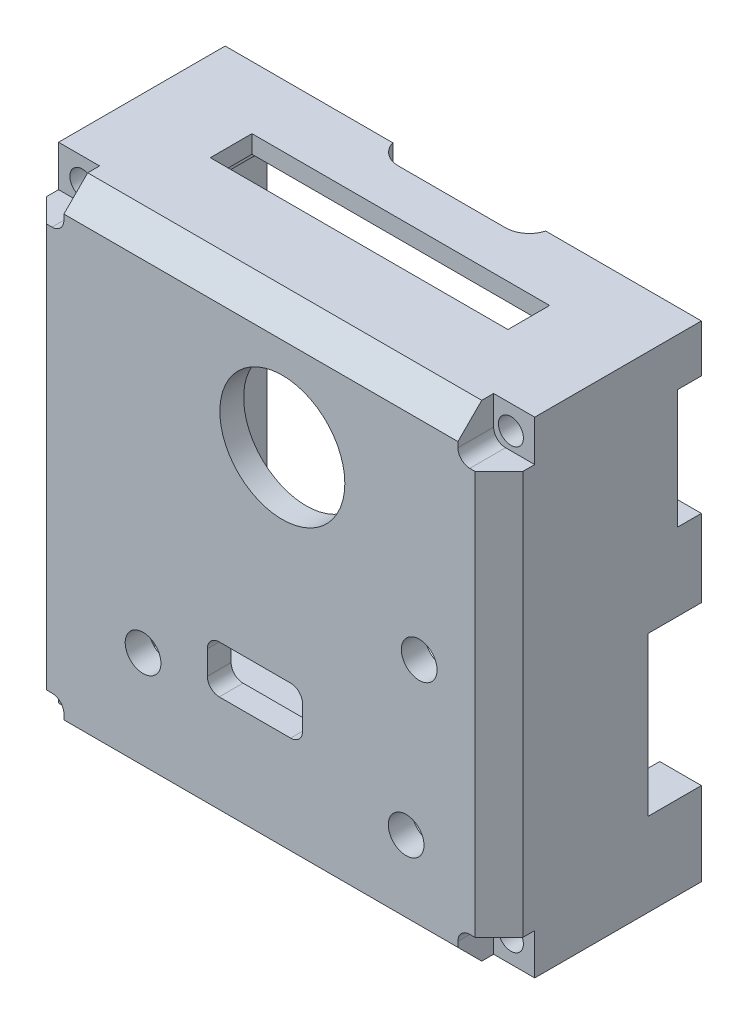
ISO-10303-21;
HEADER;
FILE_DESCRIPTION(('STEP AP214'),'2;1');
FILE_NAME('part.step','',(''),(''),'','','');
FILE_SCHEMA(('AUTOMOTIVE_DESIGN { 1 0 10303 214 1 1 1 1 }'));
ENDSEC;
DATA;
#1=APPLICATION_CONTEXT('core data for automotive mechanical design processes');
#2=APPLICATION_PROTOCOL_DEFINITION('international standard','automotive_design',2000,#1);
#3=PRODUCT_CONTEXT('',#1,'mechanical');
#4=PRODUCT('Part','Part','',(#3));
#5=PRODUCT_RELATED_PRODUCT_CATEGORY('part','',(#4));
#6=PRODUCT_DEFINITION_FORMATION('','',#4);
#7=PRODUCT_DEFINITION_CONTEXT('part definition',#1,'design');
#8=PRODUCT_DEFINITION('design','',#6,#7);
#9=PRODUCT_DEFINITION_SHAPE('','',#8);
#10=(LENGTH_UNIT() NAMED_UNIT(*) SI_UNIT(.MILLI.,.METRE.));
#11=(NAMED_UNIT(*) PLANE_ANGLE_UNIT() SI_UNIT($,.RADIAN.));
#12=(NAMED_UNIT(*) SI_UNIT($,.STERADIAN.) SOLID_ANGLE_UNIT());
#13=UNCERTAINTY_MEASURE_WITH_UNIT(LENGTH_MEASURE(1.E-05),#10,'distance_accuracy_value','');
#14=(GEOMETRIC_REPRESENTATION_CONTEXT(3) GLOBAL_UNCERTAINTY_ASSIGNED_CONTEXT((#13)) GLOBAL_UNIT_ASSIGNED_CONTEXT((#10,
#11,#12)) REPRESENTATION_CONTEXT('',''));
#15=CARTESIAN_POINT('',(0.,0.,0.));
#16=DIRECTION('',(0.,0.,1.));
#17=DIRECTION('',(1.,0.,0.));
#18=AXIS2_PLACEMENT_3D('',#15,#16,#17);
#19=CARTESIAN_POINT('',(16.5,16.8,15.));
#20=DIRECTION('',(0.,1.,0.));
#21=DIRECTION('',(0.,0.,1.));
#22=AXIS2_PLACEMENT_3D('',#19,#20,#21);
#23=PLANE('',#22);
#24=DIRECTION('',(1.,0.,0.));
#25=VECTOR('',#24,1.);
#26=CARTESIAN_POINT('',(16.5,16.8,15.));
#27=LINE('',#26,#25);
#28=CARTESIAN_POINT('',(15.3781554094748,16.8,15.));
#29=VERTEX_POINT('',#28);
#30=CARTESIAN_POINT('',(16.5,16.8,15.));
#31=VERTEX_POINT('',#30);
#32=EDGE_CURVE('E713',#29,#31,#27,.T.);
#33=ORIENTED_EDGE('',*,*,#32,.F.);
#34=DIRECTION('',(0.,0.,-1.));
#35=VECTOR('',#34,1.);
#36=CARTESIAN_POINT('',(15.3781554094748,16.8,15.));
#37=LINE('',#36,#35);
#38=CARTESIAN_POINT('',(15.3781554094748,16.8,0.));
#39=VERTEX_POINT('',#38);
#40=EDGE_CURVE('E477',#29,#39,#37,.T.);
#41=ORIENTED_EDGE('',*,*,#40,.T.);
#42=DIRECTION('',(1.,0.,0.));
#43=VECTOR('',#42,1.);
#44=CARTESIAN_POINT('',(16.5,16.8,0.));
#45=LINE('',#44,#43);
#46=CARTESIAN_POINT('',(16.5,16.8,0.));
#47=VERTEX_POINT('',#46);
#48=EDGE_CURVE('E730',#39,#47,#45,.T.);
#49=ORIENTED_EDGE('',*,*,#48,.T.);
#50=DIRECTION('',(0.,0.,-1.));
#51=VECTOR('',#50,1.);
#52=CARTESIAN_POINT('',(16.5,16.8,15.));
#53=LINE('',#52,#51);
#54=EDGE_CURVE('E752',#31,#47,#53,.T.);
#55=ORIENTED_EDGE('',*,*,#54,.F.);
#56=EDGE_LOOP('',(#33,#41,#49,#55));
#57=FACE_BOUND('',#56,.T.);
#58=ADVANCED_FACE('F47',(#57),#23,.F.);
#59=CARTESIAN_POINT('',(0.,0.,0.));
#60=DIRECTION('',(0.,0.,1.));
#61=DIRECTION('',(1.,0.,0.));
#62=AXIS2_PLACEMENT_3D('',#59,#60,#61);
#63=PLANE('',#62);
#64=CARTESIAN_POINT('',(18.,18.4,0.));
#65=DIRECTION('',(0.,0.,1.));
#66=DIRECTION('',(1.,0.,0.));
#67=AXIS2_PLACEMENT_3D('',#64,#65,#66);
#68=CIRCLE('',#67,1.05);
#69=CARTESIAN_POINT('',(19.05,18.4,0.));
#70=VERTEX_POINT('',#69);
#71=EDGE_CURVE('E819',#70,#70,#68,.T.);
#72=ORIENTED_EDGE('',*,*,#71,.T.);
#73=EDGE_LOOP('',(#72));
#74=FACE_BOUND('',#73,.T.);
#75=DIRECTION('',(0.,-1.,0.));
#76=VECTOR('',#75,1.);
#77=CARTESIAN_POINT('',(15.3781554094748,14.7,0.));
#78=LINE('',#77,#76);
#79=CARTESIAN_POINT('',(15.3781554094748,18.9,0.));
#80=VERTEX_POINT('',#79);
#81=EDGE_CURVE('E437',#80,#39,#78,.T.);
#82=ORIENTED_EDGE('',*,*,#81,.F.);
#83=DIRECTION('',(1.,0.,0.));
#84=VECTOR('',#83,1.);
#85=CARTESIAN_POINT('',(15.3781554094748,18.9,0.));
#86=LINE('',#85,#84);
#87=CARTESIAN_POINT('',(6.92288845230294,18.9,0.));
#88=VERTEX_POINT('',#87);
#89=EDGE_CURVE('E444',#88,#80,#86,.T.);
#90=ORIENTED_EDGE('',*,*,#89,.F.);
#91=DIRECTION('',(0.,1.,0.));
#92=VECTOR('',#91,1.);
#93=CARTESIAN_POINT('',(6.92288845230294,10.4,0.));
#94=LINE('',#93,#92);
#95=CARTESIAN_POINT('',(6.92288845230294,20.4,0.));
#96=VERTEX_POINT('',#95);
#97=EDGE_CURVE('E503',#88,#96,#94,.T.);
#98=ORIENTED_EDGE('',*,*,#97,.T.);
#99=DIRECTION('',(-1.,0.,0.));
#100=VECTOR('',#99,1.);
#101=CARTESIAN_POINT('',(-20.,20.4,0.));
#102=LINE('',#101,#100);
#103=CARTESIAN_POINT('',(20.,20.4,0.));
#104=VERTEX_POINT('',#103);
#105=EDGE_CURVE('E765',#104,#96,#102,.T.);
#106=ORIENTED_EDGE('',*,*,#105,.F.);
#107=DIRECTION('',(0.,1.,0.));
#108=VECTOR('',#107,1.);
#109=CARTESIAN_POINT('',(20.,20.4,0.));
#110=LINE('',#109,#108);
#111=CARTESIAN_POINT('',(20.,16.4,0.));
#112=VERTEX_POINT('',#111);
#113=EDGE_CURVE('E747',#112,#104,#110,.T.);
#114=ORIENTED_EDGE('',*,*,#113,.F.);
#115=DIRECTION('',(-1.,0.,0.));
#116=VECTOR('',#115,1.);
#117=CARTESIAN_POINT('',(0.,16.4,0.));
#118=LINE('',#117,#116);
#119=CARTESIAN_POINT('',(16.5,16.4,0.));
#120=VERTEX_POINT('',#119);
#121=EDGE_CURVE('E700',#112,#120,#118,.T.);
#122=ORIENTED_EDGE('',*,*,#121,.T.);
#123=DIRECTION('',(0.,-1.,0.));
#124=VECTOR('',#123,1.);
#125=CARTESIAN_POINT('',(16.5,-16.8,0.));
#126=LINE('',#125,#124);
#127=EDGE_CURVE('E736',#47,#120,#126,.T.);
#128=ORIENTED_EDGE('',*,*,#127,.F.);
#129=ORIENTED_EDGE('',*,*,#48,.F.);
#130=EDGE_LOOP('',(#82,#90,#98,#106,#114,#122,#128,#129));
#131=FACE_BOUND('',#130,.T.);
#132=ADVANCED_FACE('F1059',(#74,#131),#63,.F.);
#133=CARTESIAN_POINT('',(-18.,18.4,-3.));
#134=DIRECTION('',(0.,0.,1.));
#135=DIRECTION('',(1.,0.,0.));
#136=AXIS2_PLACEMENT_3D('',#133,#134,#135);
#137=CYLINDRICAL_SURFACE('',#136,1.05);
#138=CARTESIAN_POINT('',(-18.,18.4,0.));
#139=DIRECTION('',(0.,0.,1.));
#140=DIRECTION('',(1.,0.,0.));
#141=AXIS2_PLACEMENT_3D('',#138,#139,#140);
#142=CIRCLE('',#141,1.05);
#143=CARTESIAN_POINT('',(-16.95,18.4,0.));
#144=VERTEX_POINT('',#143);
#145=EDGE_CURVE('E815',#144,#144,#142,.T.);
#146=ORIENTED_EDGE('',*,*,#145,.F.);
#147=EDGE_LOOP('',(#146));
#148=FACE_BOUND('',#147,.T.);
#149=CARTESIAN_POINT('',(-18.,18.4,14.));
#150=DIRECTION('',(0.,0.,1.));
#151=DIRECTION('',(1.,0.,0.));
#152=AXIS2_PLACEMENT_3D('',#149,#150,#151);
#153=CIRCLE('',#152,1.05);
#154=CARTESIAN_POINT('',(-16.95,18.4,14.));
#155=VERTEX_POINT('',#154);
#156=EDGE_CURVE('E820',#155,#155,#153,.F.);
#157=ORIENTED_EDGE('',*,*,#156,.F.);
#158=EDGE_LOOP('',(#157));
#159=FACE_BOUND('',#158,.T.);
#160=ADVANCED_FACE('F1067',(#148,#159),#137,.F.);
#161=CARTESIAN_POINT('',(18.,18.4,-3.));
#162=DIRECTION('',(0.,0.,1.));
#163=DIRECTION('',(1.,0.,0.));
#164=AXIS2_PLACEMENT_3D('',#161,#162,#163);
#165=CYLINDRICAL_SURFACE('',#164,1.05);
#166=ORIENTED_EDGE('',*,*,#71,.F.);
#167=EDGE_LOOP('',(#166));
#168=FACE_BOUND('',#167,.T.);
#169=CARTESIAN_POINT('',(18.,18.4,14.));
#170=DIRECTION('',(0.,0.,1.));
#171=DIRECTION('',(1.,0.,0.));
#172=AXIS2_PLACEMENT_3D('',#169,#170,#171);
#173=CIRCLE('',#172,1.05);
#174=CARTESIAN_POINT('',(19.05,18.4,14.));
#175=VERTEX_POINT('',#174);
#176=EDGE_CURVE('E838',#175,#175,#173,.F.);
#177=ORIENTED_EDGE('',*,*,#176,.F.);
#178=EDGE_LOOP('',(#177));
#179=FACE_BOUND('',#178,.T.);
#180=ADVANCED_FACE('F1340',(#168,#179),#165,.F.);
#181=CARTESIAN_POINT('',(18.,-18.4,-3.));
#182=DIRECTION('',(0.,0.,1.));
#183=DIRECTION('',(1.,0.,0.));
#184=AXIS2_PLACEMENT_3D('',#181,#182,#183);
#185=CYLINDRICAL_SURFACE('',#184,1.05);
#186=CARTESIAN_POINT('',(18.,-18.4,0.));
#187=DIRECTION('',(0.,0.,1.));
#188=DIRECTION('',(1.,0.,0.));
#189=AXIS2_PLACEMENT_3D('',#186,#187,#188);
#190=CIRCLE('',#189,1.05);
#191=CARTESIAN_POINT('',(19.05,-18.4,0.));
#192=VERTEX_POINT('',#191);
#193=EDGE_CURVE('E824',#192,#192,#190,.T.);
#194=ORIENTED_EDGE('',*,*,#193,.F.);
#195=EDGE_LOOP('',(#194));
#196=FACE_BOUND('',#195,.T.);
#197=CARTESIAN_POINT('',(18.,-18.4,14.));
#198=DIRECTION('',(0.,0.,1.));
#199=DIRECTION('',(1.,0.,0.));
#200=AXIS2_PLACEMENT_3D('',#197,#198,#199);
#201=CIRCLE('',#200,1.05);
#202=CARTESIAN_POINT('',(19.05,-18.4,14.));
#203=VERTEX_POINT('',#202);
#204=EDGE_CURVE('E834',#203,#203,#201,.F.);
#205=ORIENTED_EDGE('',*,*,#204,.F.);
#206=EDGE_LOOP('',(#205));
#207=FACE_BOUND('',#206,.T.);
#208=ADVANCED_FACE('F1343',(#196,#207),#185,.F.);
#209=CARTESIAN_POINT('',(-18.,-18.4,-3.));
#210=DIRECTION('',(0.,0.,1.));
#211=DIRECTION('',(1.,0.,0.));
#212=AXIS2_PLACEMENT_3D('',#209,#210,#211);
#213=CYLINDRICAL_SURFACE('',#212,1.05);
#214=CARTESIAN_POINT('',(-18.,-18.4,0.));
#215=DIRECTION('',(0.,0.,1.));
#216=DIRECTION('',(1.,0.,0.));
#217=AXIS2_PLACEMENT_3D('',#214,#215,#216);
#218=CIRCLE('',#217,1.05);
#219=CARTESIAN_POINT('',(-16.95,-18.4,0.));
#220=VERTEX_POINT('',#219);
#221=EDGE_CURVE('E683',#220,#220,#218,.T.);
#222=ORIENTED_EDGE('',*,*,#221,.F.);
#223=EDGE_LOOP('',(#222));
#224=FACE_BOUND('',#223,.T.);
#225=CARTESIAN_POINT('',(-18.,-18.4,14.));
#226=DIRECTION('',(0.,0.,1.));
#227=DIRECTION('',(1.,0.,0.));
#228=AXIS2_PLACEMENT_3D('',#225,#226,#227);
#229=CIRCLE('',#228,1.05);
#230=CARTESIAN_POINT('',(-16.95,-18.4,14.));
#231=VERTEX_POINT('',#230);
#232=EDGE_CURVE('E653',#231,#231,#229,.F.);
#233=ORIENTED_EDGE('',*,*,#232,.F.);
#234=EDGE_LOOP('',(#233));
#235=FACE_BOUND('',#234,.T.);
#236=ADVANCED_FACE('F1346',(#224,#235),#213,.F.);
#237=CARTESIAN_POINT('',(16.5,6.4,0.));
#238=VERTEX_POINT('',#237);
#239=CARTESIAN_POINT('',(16.5,-0.100000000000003,0.));
#240=VERTEX_POINT('',#239);
#241=EDGE_CURVE('E740',#238,#240,#126,.T.);
#242=ORIENTED_EDGE('',*,*,#241,.F.);
#243=DIRECTION('',(1.,0.,0.));
#244=VECTOR('',#243,1.);
#245=CARTESIAN_POINT('',(0.,6.4,0.));
#246=LINE('',#245,#244);
#247=CARTESIAN_POINT('',(20.,6.4,0.));
#248=VERTEX_POINT('',#247);
#249=EDGE_CURVE('E704',#238,#248,#246,.T.);
#250=ORIENTED_EDGE('',*,*,#249,.T.);
#251=CARTESIAN_POINT('',(20.,-0.100000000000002,0.));
#252=VERTEX_POINT('',#251);
#253=EDGE_CURVE('E764',#252,#248,#110,.T.);
#254=ORIENTED_EDGE('',*,*,#253,.F.);
#255=DIRECTION('',(-1.,0.,0.));
#256=VECTOR('',#255,1.);
#257=CARTESIAN_POINT('',(0.,-0.100000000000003,0.));
#258=LINE('',#257,#256);
#259=EDGE_CURVE('E673',#252,#240,#258,.T.);
#260=ORIENTED_EDGE('',*,*,#259,.T.);
#261=EDGE_LOOP('',(#242,#250,#254,#260));
#262=FACE_BOUND('',#261,.T.);
#263=ADVANCED_FACE('F1070',(#262),#63,.F.);
#264=CARTESIAN_POINT('',(20.,20.4,17.));
#265=DIRECTION('',(-1.,0.,0.));
#266=DIRECTION('',(0.,-1.,0.));
#267=AXIS2_PLACEMENT_3D('',#264,#265,#266);
#268=PLANE('',#267);
#269=DIRECTION('',(0.,0.,1.));
#270=VECTOR('',#269,1.);
#271=CARTESIAN_POINT('',(20.,16.95,14.));
#272=LINE('',#271,#270);
#273=CARTESIAN_POINT('',(20.,16.95,14.));
#274=VERTEX_POINT('',#273);
#275=CARTESIAN_POINT('',(20.,16.95,15.));
#276=VERTEX_POINT('',#275);
#277=EDGE_CURVE('E601',#274,#276,#272,.T.);
#278=ORIENTED_EDGE('',*,*,#277,.T.);
#279=DIRECTION('',(0.,-1.,0.));
#280=VECTOR('',#279,1.);
#281=CARTESIAN_POINT('',(20.,-16.95,15.));
#282=LINE('',#281,#280);
#283=CARTESIAN_POINT('',(20.,-16.95,15.));
#284=VERTEX_POINT('',#283);
#285=EDGE_CURVE('E911',#276,#284,#282,.T.);
#286=ORIENTED_EDGE('',*,*,#285,.T.);
#287=DIRECTION('',(0.,0.,1.));
#288=VECTOR('',#287,1.);
#289=CARTESIAN_POINT('',(20.,-16.95,14.));
#290=LINE('',#289,#288);
#291=CARTESIAN_POINT('',(20.,-16.95,14.));
#292=VERTEX_POINT('',#291);
#293=EDGE_CURVE('E539',#292,#284,#290,.T.);
#294=ORIENTED_EDGE('',*,*,#293,.F.);
#295=DIRECTION('',(0.,1.,0.));
#296=VECTOR('',#295,1.);
#297=CARTESIAN_POINT('',(20.,-20.4,14.));
#298=LINE('',#297,#296);
#299=CARTESIAN_POINT('',(20.,-20.4,14.));
#300=VERTEX_POINT('',#299);
#301=EDGE_CURVE('E564',#300,#292,#298,.T.);
#302=ORIENTED_EDGE('',*,*,#301,.F.);
#303=DIRECTION('',(0.,0.,-1.));
#304=VECTOR('',#303,1.);
#305=CARTESIAN_POINT('',(20.,-20.4,17.));
#306=LINE('',#305,#304);
#307=CARTESIAN_POINT('',(20.,-20.4,0.));
#308=VERTEX_POINT('',#307);
#309=EDGE_CURVE('E777',#300,#308,#306,.T.);
#310=ORIENTED_EDGE('',*,*,#309,.T.);
#311=CARTESIAN_POINT('',(20.,-13.4,0.));
#312=VERTEX_POINT('',#311);
#313=EDGE_CURVE('E759',#308,#312,#110,.T.);
#314=ORIENTED_EDGE('',*,*,#313,.T.);
#315=DIRECTION('',(0.,0.,-1.));
#316=VECTOR('',#315,1.);
#317=CARTESIAN_POINT('',(20.,-13.4,4.5));
#318=LINE('',#317,#316);
#319=CARTESIAN_POINT('',(20.,-13.4,4.5));
#320=VERTEX_POINT('',#319);
#321=EDGE_CURVE('E679',#320,#312,#318,.T.);
#322=ORIENTED_EDGE('',*,*,#321,.F.);
#323=DIRECTION('',(0.,-1.,0.));
#324=VECTOR('',#323,1.);
#325=CARTESIAN_POINT('',(20.,-0.100000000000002,4.5));
#326=LINE('',#325,#324);
#327=CARTESIAN_POINT('',(20.,-0.100000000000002,4.5));
#328=VERTEX_POINT('',#327);
#329=EDGE_CURVE('E686',#328,#320,#326,.T.);
#330=ORIENTED_EDGE('',*,*,#329,.F.);
#331=DIRECTION('',(0.,0.,1.));
#332=VECTOR('',#331,1.);
#333=CARTESIAN_POINT('',(20.,-0.100000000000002,4.5));
#334=LINE('',#333,#332);
#335=EDGE_CURVE('E662',#252,#328,#334,.T.);
#336=ORIENTED_EDGE('',*,*,#335,.F.);
#337=ORIENTED_EDGE('',*,*,#253,.T.);
#338=DIRECTION('',(0.,0.,-1.));
#339=VECTOR('',#338,1.);
#340=CARTESIAN_POINT('',(20.,6.4,2.));
#341=LINE('',#340,#339);
#342=CARTESIAN_POINT('',(20.,6.4,2.));
#343=VERTEX_POINT('',#342);
#344=EDGE_CURVE('E666',#343,#248,#341,.T.);
#345=ORIENTED_EDGE('',*,*,#344,.F.);
#346=DIRECTION('',(0.,-1.,0.));
#347=VECTOR('',#346,1.);
#348=CARTESIAN_POINT('',(20.,16.4,2.));
#349=LINE('',#348,#347);
#350=CARTESIAN_POINT('',(20.,16.4,2.));
#351=VERTEX_POINT('',#350);
#352=EDGE_CURVE('E661',#351,#343,#349,.T.);
#353=ORIENTED_EDGE('',*,*,#352,.F.);
#354=DIRECTION('',(0.,0.,1.));
#355=VECTOR('',#354,1.);
#356=CARTESIAN_POINT('',(20.,16.4,2.));
#357=LINE('',#356,#355);
#358=EDGE_CURVE('E657',#112,#351,#357,.T.);
#359=ORIENTED_EDGE('',*,*,#358,.F.);
#360=ORIENTED_EDGE('',*,*,#113,.T.);
#361=DIRECTION('',(0.,0.,-1.));
#362=VECTOR('',#361,1.);
#363=CARTESIAN_POINT('',(20.,20.4,17.));
#364=LINE('',#363,#362);
#365=CARTESIAN_POINT('',(20.,20.4,14.));
#366=VERTEX_POINT('',#365);
#367=EDGE_CURVE('E787',#366,#104,#364,.T.);
#368=ORIENTED_EDGE('',*,*,#367,.F.);
#369=DIRECTION('',(0.,1.,0.));
#370=VECTOR('',#369,1.);
#371=CARTESIAN_POINT('',(20.,20.4,14.));
#372=LINE('',#371,#370);
#373=EDGE_CURVE('E619',#274,#366,#372,.T.);
#374=ORIENTED_EDGE('',*,*,#373,.F.);
#375=EDGE_LOOP('',(#278,#286,#294,#302,#310,#314,#322,#330,#336,#337,#345,#353,#359,#360,#368,#374));
#376=FACE_BOUND('',#375,.T.);
#377=ADVANCED_FACE('F1120',(#376),#268,.F.);
#378=CARTESIAN_POINT('',(-20.,20.4,17.));
#379=DIRECTION('',(0.,-1.,0.));
#380=DIRECTION('',(0.,0.,-1.));
#381=AXIS2_PLACEMENT_3D('',#378,#379,#380);
#382=PLANE('',#381);
#383=DIRECTION('',(-1.,0.,0.));
#384=VECTOR('',#383,1.);
#385=CARTESIAN_POINT('',(-12.5,20.4,5.25));
#386=LINE('',#385,#384);
#387=CARTESIAN_POINT('',(12.5,20.4,5.25));
#388=VERTEX_POINT('',#387);
#389=CARTESIAN_POINT('',(-12.5,20.4,5.25));
#390=VERTEX_POINT('',#389);
#391=EDGE_CURVE('E414',#388,#390,#386,.T.);
#392=ORIENTED_EDGE('',*,*,#391,.F.);
#393=DIRECTION('',(0.,0.,-1.));
#394=VECTOR('',#393,1.);
#395=CARTESIAN_POINT('',(12.5,20.4,5.25));
#396=LINE('',#395,#394);
#397=CARTESIAN_POINT('',(12.5,20.4,8.75));
#398=VERTEX_POINT('',#397);
#399=EDGE_CURVE('E63',#398,#388,#396,.T.);
#400=ORIENTED_EDGE('',*,*,#399,.F.);
#401=DIRECTION('',(1.,0.,0.));
#402=VECTOR('',#401,1.);
#403=CARTESIAN_POINT('',(-12.5,20.4,8.75));
#404=LINE('',#403,#402);
#405=CARTESIAN_POINT('',(-12.5,20.4,8.75));
#406=VERTEX_POINT('',#405);
#407=EDGE_CURVE('E422',#406,#398,#404,.T.);
#408=ORIENTED_EDGE('',*,*,#407,.F.);
#409=DIRECTION('',(0.,0.,1.));
#410=VECTOR('',#409,1.);
#411=CARTESIAN_POINT('',(-12.5,20.4,5.25));
#412=LINE('',#411,#410);
#413=EDGE_CURVE('E404',#390,#406,#412,.T.);
#414=ORIENTED_EDGE('',*,*,#413,.F.);
#415=EDGE_LOOP('',(#392,#400,#408,#414));
#416=FACE_BOUND('',#415,.T.);
#417=ORIENTED_EDGE('',*,*,#105,.T.);
#418=CARTESIAN_POINT('',(5.,20.4,-0.550000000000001));
#419=DIRECTION('',(0.,1.,0.));
#420=DIRECTION('',(0.,0.,-1.));
#421=AXIS2_PLACEMENT_3D('',#418,#419,#420);
#422=CIRCLE('',#421,2.);
#423=CARTESIAN_POINT('',(5.,20.4,1.45));
#424=VERTEX_POINT('',#423);
#425=EDGE_CURVE('E489',#424,#96,#422,.T.);
#426=ORIENTED_EDGE('',*,*,#425,.F.);
#427=DIRECTION('',(1.,0.,0.));
#428=VECTOR('',#427,1.);
#429=CARTESIAN_POINT('',(-4.,20.4,1.45));
#430=LINE('',#429,#428);
#431=CARTESIAN_POINT('',(-4.,20.4,1.45));
#432=VERTEX_POINT('',#431);
#433=EDGE_CURVE('E485',#432,#424,#430,.T.);
#434=ORIENTED_EDGE('',*,*,#433,.F.);
#435=CARTESIAN_POINT('',(-4.,20.4,-0.550000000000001));
#436=DIRECTION('',(0.,1.,0.));
#437=DIRECTION('',(0.,0.,1.));
#438=AXIS2_PLACEMENT_3D('',#435,#436,#437);
#439=CIRCLE('',#438,2.);
#440=CARTESIAN_POINT('',(-5.92288845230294,20.4,0.));
#441=VERTEX_POINT('',#440);
#442=EDGE_CURVE('E481',#441,#432,#439,.T.);
#443=ORIENTED_EDGE('',*,*,#442,.F.);
#444=CARTESIAN_POINT('',(-20.,20.4,0.));
#445=VERTEX_POINT('',#444);
#446=EDGE_CURVE('E763',#441,#445,#102,.T.);
#447=ORIENTED_EDGE('',*,*,#446,.T.);
#448=DIRECTION('',(0.,0.,-1.));
#449=VECTOR('',#448,1.);
#450=CARTESIAN_POINT('',(-20.,20.4,17.));
#451=LINE('',#450,#449);
#452=CARTESIAN_POINT('',(-20.,20.4,14.));
#453=VERTEX_POINT('',#452);
#454=EDGE_CURVE('E783',#453,#445,#451,.T.);
#455=ORIENTED_EDGE('',*,*,#454,.F.);
#456=DIRECTION('',(-1.,0.,0.));
#457=VECTOR('',#456,1.);
#458=CARTESIAN_POINT('',(-20.,20.4,14.));
#459=LINE('',#458,#457);
#460=CARTESIAN_POINT('',(-16.55,20.4,14.));
#461=VERTEX_POINT('',#460);
#462=EDGE_CURVE('E640',#461,#453,#459,.T.);
#463=ORIENTED_EDGE('',*,*,#462,.F.);
#464=DIRECTION('',(0.,0.,1.));
#465=VECTOR('',#464,1.);
#466=CARTESIAN_POINT('',(-16.55,20.4,14.));
#467=LINE('',#466,#465);
#468=CARTESIAN_POINT('',(-16.55,20.4,15.));
#469=VERTEX_POINT('',#468);
#470=EDGE_CURVE('E649',#461,#469,#467,.T.);
#471=ORIENTED_EDGE('',*,*,#470,.T.);
#472=DIRECTION('',(1.,0.,0.));
#473=VECTOR('',#472,1.);
#474=CARTESIAN_POINT('',(16.55,20.4,15.));
#475=LINE('',#474,#473);
#476=CARTESIAN_POINT('',(16.55,20.4,15.));
#477=VERTEX_POINT('',#476);
#478=EDGE_CURVE('E893',#469,#477,#475,.T.);
#479=ORIENTED_EDGE('',*,*,#478,.T.);
#480=DIRECTION('',(0.,0.,1.));
#481=VECTOR('',#480,1.);
#482=CARTESIAN_POINT('',(16.55,20.4,14.));
#483=LINE('',#482,#481);
#484=CARTESIAN_POINT('',(16.55,20.4,14.));
#485=VERTEX_POINT('',#484);
#486=EDGE_CURVE('E557',#485,#477,#483,.T.);
#487=ORIENTED_EDGE('',*,*,#486,.F.);
#488=DIRECTION('',(-1.,0.,0.));
#489=VECTOR('',#488,1.);
#490=CARTESIAN_POINT('',(16.55,20.4,14.));
#491=LINE('',#490,#489);
#492=EDGE_CURVE('E605',#366,#485,#491,.T.);
#493=ORIENTED_EDGE('',*,*,#492,.F.);
#494=ORIENTED_EDGE('',*,*,#367,.T.);
#495=EDGE_LOOP('',(#417,#426,#434,#443,#447,#455,#463,#471,#479,#487,#493,#494));
#496=FACE_BOUND('',#495,.T.);
#497=ADVANCED_FACE('F419',(#416,#496),#382,.F.);
#498=CARTESIAN_POINT('',(-20.,20.4,17.));
#499=DIRECTION('',(1.,0.,0.));
#500=DIRECTION('',(0.,1.,0.));
#501=AXIS2_PLACEMENT_3D('',#498,#499,#500);
#502=PLANE('',#501);
#503=DIRECTION('',(0.,0.,1.));
#504=VECTOR('',#503,1.);
#505=CARTESIAN_POINT('',(-20.,-16.95,14.));
#506=LINE('',#505,#504);
#507=CARTESIAN_POINT('',(-20.,-16.95,14.));
#508=VERTEX_POINT('',#507);
#509=CARTESIAN_POINT('',(-20.,-16.95,15.));
#510=VERTEX_POINT('',#509);
#511=EDGE_CURVE('E575',#508,#510,#506,.T.);
#512=ORIENTED_EDGE('',*,*,#511,.T.);
#513=DIRECTION('',(0.,1.,0.));
#514=VECTOR('',#513,1.);
#515=CARTESIAN_POINT('',(-20.,16.95,15.));
#516=LINE('',#515,#514);
#517=CARTESIAN_POINT('',(-20.,16.95,15.));
#518=VERTEX_POINT('',#517);
#519=EDGE_CURVE('E920',#510,#518,#516,.T.);
#520=ORIENTED_EDGE('',*,*,#519,.T.);
#521=DIRECTION('',(0.,0.,1.));
#522=VECTOR('',#521,1.);
#523=CARTESIAN_POINT('',(-20.,16.95,14.));
#524=LINE('',#523,#522);
#525=CARTESIAN_POINT('',(-20.,16.95,14.));
#526=VERTEX_POINT('',#525);
#527=EDGE_CURVE('E643',#526,#518,#524,.T.);
#528=ORIENTED_EDGE('',*,*,#527,.F.);
#529=DIRECTION('',(0.,-1.,0.));
#530=VECTOR('',#529,1.);
#531=CARTESIAN_POINT('',(-20.,20.4,14.));
#532=LINE('',#531,#530);
#533=EDGE_CURVE('E628',#453,#526,#532,.T.);
#534=ORIENTED_EDGE('',*,*,#533,.F.);
#535=ORIENTED_EDGE('',*,*,#454,.T.);
#536=DIRECTION('',(0.,-1.,0.));
#537=VECTOR('',#536,1.);
#538=CARTESIAN_POINT('',(-20.,20.4,0.));
#539=LINE('',#538,#537);
#540=CARTESIAN_POINT('',(-20.,-20.4,0.));
#541=VERTEX_POINT('',#540);
#542=EDGE_CURVE('E769',#445,#541,#539,.T.);
#543=ORIENTED_EDGE('',*,*,#542,.T.);
#544=DIRECTION('',(0.,0.,-1.));
#545=VECTOR('',#544,1.);
#546=CARTESIAN_POINT('',(-20.,-20.4,17.));
#547=LINE('',#546,#545);
#548=CARTESIAN_POINT('',(-20.,-20.4,14.));
#549=VERTEX_POINT('',#548);
#550=EDGE_CURVE('E780',#549,#541,#547,.T.);
#551=ORIENTED_EDGE('',*,*,#550,.F.);
#552=DIRECTION('',(0.,-1.,0.));
#553=VECTOR('',#552,1.);
#554=CARTESIAN_POINT('',(-20.,-20.4,14.));
#555=LINE('',#554,#553);
#556=EDGE_CURVE('E574',#508,#549,#555,.T.);
#557=ORIENTED_EDGE('',*,*,#556,.F.);
#558=EDGE_LOOP('',(#512,#520,#528,#534,#535,#543,#551,#557));
#559=FACE_BOUND('',#558,.T.);
#560=ADVANCED_FACE('F1152',(#559),#502,.F.);
#561=CARTESIAN_POINT('',(-20.,-20.4,17.));
#562=DIRECTION('',(0.,1.,0.));
#563=DIRECTION('',(0.,0.,1.));
#564=AXIS2_PLACEMENT_3D('',#561,#562,#563);
#565=PLANE('',#564);
#566=DIRECTION('',(0.,0.,1.));
#567=VECTOR('',#566,1.);
#568=CARTESIAN_POINT('',(16.55,-20.4,14.));
#569=LINE('',#568,#567);
#570=CARTESIAN_POINT('',(16.55,-20.4,14.));
#571=VERTEX_POINT('',#570);
#572=CARTESIAN_POINT('',(16.55,-20.4,15.));
#573=VERTEX_POINT('',#572);
#574=EDGE_CURVE('E544',#571,#573,#569,.T.);
#575=ORIENTED_EDGE('',*,*,#574,.T.);
#576=DIRECTION('',(-1.,0.,0.));
#577=VECTOR('',#576,1.);
#578=CARTESIAN_POINT('',(-16.55,-20.4,15.));
#579=LINE('',#578,#577);
#580=CARTESIAN_POINT('',(-16.55,-20.4,15.));
#581=VERTEX_POINT('',#580);
#582=EDGE_CURVE('E902',#573,#581,#579,.T.);
#583=ORIENTED_EDGE('',*,*,#582,.T.);
#584=DIRECTION('',(0.,0.,1.));
#585=VECTOR('',#584,1.);
#586=CARTESIAN_POINT('',(-16.55,-20.4,14.));
#587=LINE('',#586,#585);
#588=CARTESIAN_POINT('',(-16.55,-20.4,14.));
#589=VERTEX_POINT('',#588);
#590=EDGE_CURVE('E570',#589,#581,#587,.T.);
#591=ORIENTED_EDGE('',*,*,#590,.F.);
#592=DIRECTION('',(1.,0.,0.));
#593=VECTOR('',#592,1.);
#594=CARTESIAN_POINT('',(-20.,-20.4,14.));
#595=LINE('',#594,#593);
#596=EDGE_CURVE('E584',#549,#589,#595,.T.);
#597=ORIENTED_EDGE('',*,*,#596,.F.);
#598=ORIENTED_EDGE('',*,*,#550,.T.);
#599=DIRECTION('',(1.,0.,0.));
#600=VECTOR('',#599,1.);
#601=CARTESIAN_POINT('',(-20.,-20.4,0.));
#602=LINE('',#601,#600);
#603=EDGE_CURVE('E773',#541,#308,#602,.T.);
#604=ORIENTED_EDGE('',*,*,#603,.T.);
#605=ORIENTED_EDGE('',*,*,#309,.F.);
#606=DIRECTION('',(1.,0.,0.));
#607=VECTOR('',#606,1.);
#608=CARTESIAN_POINT('',(16.55,-20.4,14.));
#609=LINE('',#608,#607);
#610=EDGE_CURVE('E553',#571,#300,#609,.T.);
#611=ORIENTED_EDGE('',*,*,#610,.F.);
#612=EDGE_LOOP('',(#575,#583,#591,#597,#598,#604,#605,#611));
#613=FACE_BOUND('',#612,.T.);
#614=ADVANCED_FACE('F1147',(#613),#565,.F.);
#615=CARTESIAN_POINT('',(0.,0.,17.));
#616=DIRECTION('',(0.,0.,1.));
#617=DIRECTION('',(1.,0.,0.));
#618=AXIS2_PLACEMENT_3D('',#615,#616,#617);
#619=PLANE('',#618);
#620=CARTESIAN_POINT('',(1.8,10.6,17.));
#621=DIRECTION('',(0.,0.,1.));
#622=DIRECTION('',(1.,0.,0.));
#623=AXIS2_PLACEMENT_3D('',#620,#621,#622);
#624=CIRCLE('',#623,5.25);
#625=CARTESIAN_POINT('',(7.05,10.6,17.));
#626=VERTEX_POINT('',#625);
#627=EDGE_CURVE('E507',#626,#626,#624,.T.);
#628=ORIENTED_EDGE('',*,*,#627,.F.);
#629=EDGE_LOOP('',(#628));
#630=FACE_BOUND('',#629,.T.);
#631=DIRECTION('',(0.,1.,0.));
#632=VECTOR('',#631,1.);
#633=CARTESIAN_POINT('',(3.50000000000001,-6.20000000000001,17.));
#634=LINE('',#633,#632);
#635=CARTESIAN_POINT('',(3.50000000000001,-9.20000000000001,17.));
#636=VERTEX_POINT('',#635);
#637=CARTESIAN_POINT('',(3.50000000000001,-7.20000000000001,17.));
#638=VERTEX_POINT('',#637);
#639=EDGE_CURVE('E512',#636,#638,#634,.T.);
#640=ORIENTED_EDGE('',*,*,#639,.F.);
#641=CARTESIAN_POINT('',(2.50000000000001,-9.20000000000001,17.));
#642=DIRECTION('',(0.,0.,1.));
#643=DIRECTION('',(1.,0.,0.));
#644=AXIS2_PLACEMENT_3D('',#641,#642,#643);
#645=CIRCLE('',#644,1.);
#646=CARTESIAN_POINT('',(2.50000000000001,-10.2,17.));
#647=VERTEX_POINT('',#646);
#648=EDGE_CURVE('E960',#636,#647,#645,.F.);
#649=ORIENTED_EDGE('',*,*,#648,.T.);
#650=DIRECTION('',(1.,0.,0.));
#651=VECTOR('',#650,1.);
#652=CARTESIAN_POINT('',(-4.49999999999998,-10.2,17.));
#653=LINE('',#652,#651);
#654=CARTESIAN_POINT('',(-3.49999999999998,-10.2,17.));
#655=VERTEX_POINT('',#654);
#656=EDGE_CURVE('E513',#655,#647,#653,.T.);
#657=ORIENTED_EDGE('',*,*,#656,.F.);
#658=CARTESIAN_POINT('',(-3.49999999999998,-9.20000000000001,17.));
#659=DIRECTION('',(0.,0.,1.));
#660=DIRECTION('',(1.,0.,0.));
#661=AXIS2_PLACEMENT_3D('',#658,#659,#660);
#662=CIRCLE('',#661,1.);
#663=CARTESIAN_POINT('',(-4.49999999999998,-9.20000000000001,17.));
#664=VERTEX_POINT('',#663);
#665=EDGE_CURVE('E954',#655,#664,#662,.F.);
#666=ORIENTED_EDGE('',*,*,#665,.T.);
#667=DIRECTION('',(0.,-1.,0.));
#668=VECTOR('',#667,1.);
#669=CARTESIAN_POINT('',(-4.49999999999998,-6.2,17.));
#670=LINE('',#669,#668);
#671=CARTESIAN_POINT('',(-4.49999999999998,-7.2,17.));
#672=VERTEX_POINT('',#671);
#673=EDGE_CURVE('E517',#672,#664,#670,.T.);
#674=ORIENTED_EDGE('',*,*,#673,.F.);
#675=CARTESIAN_POINT('',(-3.49999999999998,-7.2,17.));
#676=DIRECTION('',(0.,0.,1.));
#677=DIRECTION('',(1.,0.,0.));
#678=AXIS2_PLACEMENT_3D('',#675,#676,#677);
#679=CIRCLE('',#678,1.);
#680=CARTESIAN_POINT('',(-3.49999999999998,-6.2,17.));
#681=VERTEX_POINT('',#680);
#682=EDGE_CURVE('E972',#672,#681,#679,.F.);
#683=ORIENTED_EDGE('',*,*,#682,.T.);
#684=DIRECTION('',(-1.,0.,0.));
#685=VECTOR('',#684,1.);
#686=CARTESIAN_POINT('',(-4.49999999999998,-6.2,17.));
#687=LINE('',#686,#685);
#688=CARTESIAN_POINT('',(2.50000000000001,-6.20000000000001,17.));
#689=VERTEX_POINT('',#688);
#690=EDGE_CURVE('E522',#689,#681,#687,.T.);
#691=ORIENTED_EDGE('',*,*,#690,.F.);
#692=CARTESIAN_POINT('',(2.50000000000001,-7.20000000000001,17.));
#693=DIRECTION('',(0.,0.,1.));
#694=DIRECTION('',(1.,0.,0.));
#695=AXIS2_PLACEMENT_3D('',#692,#693,#694);
#696=CIRCLE('',#695,1.);
#697=EDGE_CURVE('E966',#689,#638,#696,.F.);
#698=ORIENTED_EDGE('',*,*,#697,.T.);
#699=EDGE_LOOP('',(#640,#649,#657,#666,#674,#683,#691,#698));
#700=FACE_BOUND('',#699,.T.);
#701=CARTESIAN_POINT('',(-9.9,-10.2,17.));
#702=DIRECTION('',(0.,0.,1.));
#703=DIRECTION('',(1.,0.,0.));
#704=AXIS2_PLACEMENT_3D('',#701,#702,#703);
#705=CIRCLE('',#704,1.5);
#706=CARTESIAN_POINT('',(-8.4,-10.2,17.));
#707=VERTEX_POINT('',#706);
#708=EDGE_CURVE('E518',#707,#707,#705,.T.);
#709=ORIENTED_EDGE('',*,*,#708,.F.);
#710=EDGE_LOOP('',(#709));
#711=FACE_BOUND('',#710,.T.);
#712=CARTESIAN_POINT('',(12.2,-12.4,17.));
#713=DIRECTION('',(0.,0.,1.));
#714=DIRECTION('',(1.,0.,0.));
#715=AXIS2_PLACEMENT_3D('',#712,#713,#714);
#716=CIRCLE('',#715,1.5);
#717=CARTESIAN_POINT('',(13.7,-12.4,17.));
#718=VERTEX_POINT('',#717);
#719=EDGE_CURVE('E532',#718,#718,#716,.T.);
#720=ORIENTED_EDGE('',*,*,#719,.F.);
#721=EDGE_LOOP('',(#720));
#722=FACE_BOUND('',#721,.T.);
#723=CARTESIAN_POINT('',(13.3,0.899999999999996,17.));
#724=DIRECTION('',(0.,0.,1.));
#725=DIRECTION('',(1.,0.,0.));
#726=AXIS2_PLACEMENT_3D('',#723,#724,#725);
#727=CIRCLE('',#726,1.5);
#728=CARTESIAN_POINT('',(14.8,0.899999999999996,17.));
#729=VERTEX_POINT('',#728);
#730=EDGE_CURVE('E506',#729,#729,#727,.T.);
#731=ORIENTED_EDGE('',*,*,#730,.F.);
#732=EDGE_LOOP('',(#731));
#733=FACE_BOUND('',#732,.T.);
#734=DIRECTION('',(0.,-1.,0.));
#735=VECTOR('',#734,1.);
#736=CARTESIAN_POINT('',(16.55,20.4,17.));
#737=LINE('',#736,#735);
#738=CARTESIAN_POINT('',(16.55,18.4,17.));
#739=VERTEX_POINT('',#738);
#740=CARTESIAN_POINT('',(16.55,17.95,17.));
#741=VERTEX_POINT('',#740);
#742=EDGE_CURVE('E579',#739,#741,#737,.T.);
#743=ORIENTED_EDGE('',*,*,#742,.F.);
#744=DIRECTION('',(-1.,0.,0.));
#745=VECTOR('',#744,1.);
#746=CARTESIAN_POINT('',(-16.55,18.4,17.));
#747=LINE('',#746,#745);
#748=CARTESIAN_POINT('',(-16.55,18.4,17.));
#749=VERTEX_POINT('',#748);
#750=EDGE_CURVE('E886',#739,#749,#747,.T.);
#751=ORIENTED_EDGE('',*,*,#750,.T.);
#752=DIRECTION('',(0.,1.,0.));
#753=VECTOR('',#752,1.);
#754=CARTESIAN_POINT('',(-16.55,20.4,17.));
#755=LINE('',#754,#753);
#756=CARTESIAN_POINT('',(-16.55,17.95,17.));
#757=VERTEX_POINT('',#756);
#758=EDGE_CURVE('E633',#757,#749,#755,.T.);
#759=ORIENTED_EDGE('',*,*,#758,.F.);
#760=CARTESIAN_POINT('',(-17.55,17.95,17.));
#761=DIRECTION('',(0.,0.,1.));
#762=DIRECTION('',(1.,0.,0.));
#763=AXIS2_PLACEMENT_3D('',#760,#761,#762);
#764=CIRCLE('',#763,1.);
#765=CARTESIAN_POINT('',(-17.55,16.95,17.));
#766=VERTEX_POINT('',#765);
#767=EDGE_CURVE('E1018',#757,#766,#764,.F.);
#768=ORIENTED_EDGE('',*,*,#767,.T.);
#769=DIRECTION('',(1.,0.,0.));
#770=VECTOR('',#769,1.);
#771=CARTESIAN_POINT('',(-20.,16.95,17.));
#772=LINE('',#771,#770);
#773=CARTESIAN_POINT('',(-18.,16.95,17.));
#774=VERTEX_POINT('',#773);
#775=EDGE_CURVE('E588',#774,#766,#772,.T.);
#776=ORIENTED_EDGE('',*,*,#775,.F.);
#777=DIRECTION('',(0.,-1.,0.));
#778=VECTOR('',#777,1.);
#779=CARTESIAN_POINT('',(-18.,-16.95,17.));
#780=LINE('',#779,#778);
#781=CARTESIAN_POINT('',(-18.,-16.95,17.));
#782=VERTEX_POINT('',#781);
#783=EDGE_CURVE('E871',#774,#782,#780,.T.);
#784=ORIENTED_EDGE('',*,*,#783,.T.);
#785=DIRECTION('',(-1.,0.,0.));
#786=VECTOR('',#785,1.);
#787=CARTESIAN_POINT('',(-20.,-16.95,17.));
#788=LINE('',#787,#786);
#789=CARTESIAN_POINT('',(-17.55,-16.95,17.));
#790=VERTEX_POINT('',#789);
#791=EDGE_CURVE('E580',#790,#782,#788,.T.);
#792=ORIENTED_EDGE('',*,*,#791,.F.);
#793=CARTESIAN_POINT('',(-17.55,-17.95,17.));
#794=DIRECTION('',(0.,0.,1.));
#795=DIRECTION('',(1.,0.,0.));
#796=AXIS2_PLACEMENT_3D('',#793,#794,#795);
#797=CIRCLE('',#796,1.);
#798=CARTESIAN_POINT('',(-16.55,-17.95,17.));
#799=VERTEX_POINT('',#798);
#800=EDGE_CURVE('E1027',#790,#799,#797,.F.);
#801=ORIENTED_EDGE('',*,*,#800,.T.);
#802=DIRECTION('',(0.,1.,0.));
#803=VECTOR('',#802,1.);
#804=CARTESIAN_POINT('',(-16.55,-20.4,17.));
#805=LINE('',#804,#803);
#806=CARTESIAN_POINT('',(-16.55,-18.4,17.));
#807=VERTEX_POINT('',#806);
#808=EDGE_CURVE('E583',#807,#799,#805,.T.);
#809=ORIENTED_EDGE('',*,*,#808,.F.);
#810=DIRECTION('',(1.,0.,0.));
#811=VECTOR('',#810,1.);
#812=CARTESIAN_POINT('',(16.55,-18.4,17.));
#813=LINE('',#812,#811);
#814=CARTESIAN_POINT('',(16.55,-18.4,17.));
#815=VERTEX_POINT('',#814);
#816=EDGE_CURVE('E882',#807,#815,#813,.T.);
#817=ORIENTED_EDGE('',*,*,#816,.T.);
#818=DIRECTION('',(0.,-1.,0.));
#819=VECTOR('',#818,1.);
#820=CARTESIAN_POINT('',(16.55,-20.4,17.));
#821=LINE('',#820,#819);
#822=CARTESIAN_POINT('',(16.55,-17.95,17.));
#823=VERTEX_POINT('',#822);
#824=EDGE_CURVE('E549',#823,#815,#821,.T.);
#825=ORIENTED_EDGE('',*,*,#824,.F.);
#826=CARTESIAN_POINT('',(17.55,-17.95,17.));
#827=DIRECTION('',(0.,0.,1.));
#828=DIRECTION('',(1.,0.,0.));
#829=AXIS2_PLACEMENT_3D('',#826,#827,#828);
#830=CIRCLE('',#829,1.);
#831=CARTESIAN_POINT('',(17.55,-16.95,17.));
#832=VERTEX_POINT('',#831);
#833=EDGE_CURVE('E1024',#823,#832,#830,.F.);
#834=ORIENTED_EDGE('',*,*,#833,.T.);
#835=DIRECTION('',(-1.,0.,0.));
#836=VECTOR('',#835,1.);
#837=CARTESIAN_POINT('',(16.55,-16.95,17.));
#838=LINE('',#837,#836);
#839=CARTESIAN_POINT('',(18.,-16.95,17.));
#840=VERTEX_POINT('',#839);
#841=EDGE_CURVE('E552',#840,#832,#838,.T.);
#842=ORIENTED_EDGE('',*,*,#841,.F.);
#843=DIRECTION('',(0.,1.,0.));
#844=VECTOR('',#843,1.);
#845=CARTESIAN_POINT('',(18.,16.95,17.));
#846=LINE('',#845,#844);
#847=CARTESIAN_POINT('',(18.,16.95,17.));
#848=VERTEX_POINT('',#847);
#849=EDGE_CURVE('E878',#840,#848,#846,.T.);
#850=ORIENTED_EDGE('',*,*,#849,.T.);
#851=DIRECTION('',(1.,0.,0.));
#852=VECTOR('',#851,1.);
#853=CARTESIAN_POINT('',(16.55,16.95,17.));
#854=LINE('',#853,#852);
#855=CARTESIAN_POINT('',(17.55,16.95,17.));
#856=VERTEX_POINT('',#855);
#857=EDGE_CURVE('E609',#856,#848,#854,.T.);
#858=ORIENTED_EDGE('',*,*,#857,.F.);
#859=CARTESIAN_POINT('',(17.55,17.95,17.));
#860=DIRECTION('',(0.,0.,1.));
#861=DIRECTION('',(1.,0.,0.));
#862=AXIS2_PLACEMENT_3D('',#859,#860,#861);
#863=CIRCLE('',#862,1.);
#864=EDGE_CURVE('E1021',#856,#741,#863,.F.);
#865=ORIENTED_EDGE('',*,*,#864,.T.);
#866=EDGE_LOOP('',(#743,#751,#759,#768,#776,#784,#792,#801,#809,#817,#825,#834,#842,#850,#858,#865));
#867=FACE_BOUND('',#866,.T.);
#868=ADVANCED_FACE('F1143',(#630,#700,#711,#722,#733,#867),#619,.T.);
#869=ORIENTED_EDGE('',*,*,#221,.T.);
#870=EDGE_LOOP('',(#869));
#871=FACE_BOUND('',#870,.T.);
#872=ORIENTED_EDGE('',*,*,#193,.T.);
#873=EDGE_LOOP('',(#872));
#874=FACE_BOUND('',#873,.T.);
#875=ORIENTED_EDGE('',*,*,#145,.T.);
#876=EDGE_LOOP('',(#875));
#877=FACE_BOUND('',#876,.T.);
#878=DIRECTION('',(0.,1.,0.));
#879=VECTOR('',#878,1.);
#880=CARTESIAN_POINT('',(-5.92288845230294,10.4,0.));
#881=LINE('',#880,#879);
#882=CARTESIAN_POINT('',(-5.92288845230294,18.9,0.));
#883=VERTEX_POINT('',#882);
#884=EDGE_CURVE('E497',#441,#883,#881,.F.);
#885=ORIENTED_EDGE('',*,*,#884,.T.);
#886=CARTESIAN_POINT('',(-14.3781554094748,18.9,0.));
#887=VERTEX_POINT('',#886);
#888=EDGE_CURVE('E441',#887,#883,#86,.T.);
#889=ORIENTED_EDGE('',*,*,#888,.F.);
#890=DIRECTION('',(0.,1.,0.));
#891=VECTOR('',#890,1.);
#892=CARTESIAN_POINT('',(-14.3781554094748,14.7,0.));
#893=LINE('',#892,#891);
#894=CARTESIAN_POINT('',(-14.3781554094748,16.8,0.));
#895=VERTEX_POINT('',#894);
#896=EDGE_CURVE('E432',#895,#887,#893,.T.);
#897=ORIENTED_EDGE('',*,*,#896,.F.);
#898=CARTESIAN_POINT('',(-16.5,16.8,0.));
#899=VERTEX_POINT('',#898);
#900=EDGE_CURVE('E731',#899,#895,#45,.T.);
#901=ORIENTED_EDGE('',*,*,#900,.F.);
#902=DIRECTION('',(0.,1.,0.));
#903=VECTOR('',#902,1.);
#904=CARTESIAN_POINT('',(-16.5,-16.8,0.));
#905=LINE('',#904,#903);
#906=CARTESIAN_POINT('',(-16.5,-16.8,0.));
#907=VERTEX_POINT('',#906);
#908=EDGE_CURVE('E708',#907,#899,#905,.T.);
#909=ORIENTED_EDGE('',*,*,#908,.F.);
#910=DIRECTION('',(-1.,0.,0.));
#911=VECTOR('',#910,1.);
#912=CARTESIAN_POINT('',(16.5,-16.8,0.));
#913=LINE('',#912,#911);
#914=CARTESIAN_POINT('',(16.5,-16.8,0.));
#915=VERTEX_POINT('',#914);
#916=EDGE_CURVE('E714',#915,#907,#913,.T.);
#917=ORIENTED_EDGE('',*,*,#916,.F.);
#918=CARTESIAN_POINT('',(16.5,-13.4,0.));
#919=VERTEX_POINT('',#918);
#920=EDGE_CURVE('E735',#919,#915,#126,.T.);
#921=ORIENTED_EDGE('',*,*,#920,.F.);
#922=DIRECTION('',(1.,0.,0.));
#923=VECTOR('',#922,1.);
#924=CARTESIAN_POINT('',(0.,-13.4,0.));
#925=LINE('',#924,#923);
#926=EDGE_CURVE('E696',#919,#312,#925,.T.);
#927=ORIENTED_EDGE('',*,*,#926,.T.);
#928=ORIENTED_EDGE('',*,*,#313,.F.);
#929=ORIENTED_EDGE('',*,*,#603,.F.);
#930=ORIENTED_EDGE('',*,*,#542,.F.);
#931=ORIENTED_EDGE('',*,*,#446,.F.);
#932=EDGE_LOOP('',(#885,#889,#897,#901,#909,#917,#921,#927,#928,#929,#930,#931));
#933=FACE_BOUND('',#932,.T.);
#934=ADVANCED_FACE('F1071',(#871,#874,#877,#933),#63,.F.);
#935=CARTESIAN_POINT('',(-16.5,-16.8,15.));
#936=DIRECTION('',(-1.,0.,0.));
#937=DIRECTION('',(0.,0.,1.));
#938=AXIS2_PLACEMENT_3D('',#935,#936,#937);
#939=PLANE('',#938);
#940=ORIENTED_EDGE('',*,*,#908,.T.);
#941=DIRECTION('',(0.,0.,-1.));
#942=VECTOR('',#941,1.);
#943=CARTESIAN_POINT('',(-16.5,16.8,15.));
#944=LINE('',#943,#942);
#945=CARTESIAN_POINT('',(-16.5,16.8,15.));
#946=VERTEX_POINT('',#945);
#947=EDGE_CURVE('E727',#946,#899,#944,.T.);
#948=ORIENTED_EDGE('',*,*,#947,.F.);
#949=DIRECTION('',(0.,1.,0.));
#950=VECTOR('',#949,1.);
#951=CARTESIAN_POINT('',(-16.5,-16.8,15.));
#952=LINE('',#951,#950);
#953=CARTESIAN_POINT('',(-16.5,-16.8,15.));
#954=VERTEX_POINT('',#953);
#955=EDGE_CURVE('E709',#954,#946,#952,.T.);
#956=ORIENTED_EDGE('',*,*,#955,.F.);
#957=DIRECTION('',(0.,0.,-1.));
#958=VECTOR('',#957,1.);
#959=CARTESIAN_POINT('',(-16.5,-16.8,15.));
#960=LINE('',#959,#958);
#961=EDGE_CURVE('E744',#954,#907,#960,.T.);
#962=ORIENTED_EDGE('',*,*,#961,.T.);
#963=EDGE_LOOP('',(#940,#948,#956,#962));
#964=FACE_BOUND('',#963,.T.);
#965=ADVANCED_FACE('F1104',(#964),#939,.F.);
#966=CARTESIAN_POINT('',(16.5,-16.8,15.));
#967=DIRECTION('',(0.,-1.,0.));
#968=DIRECTION('',(0.,0.,-1.));
#969=AXIS2_PLACEMENT_3D('',#966,#967,#968);
#970=PLANE('',#969);
#971=ORIENTED_EDGE('',*,*,#916,.T.);
#972=ORIENTED_EDGE('',*,*,#961,.F.);
#973=DIRECTION('',(-1.,0.,0.));
#974=VECTOR('',#973,1.);
#975=CARTESIAN_POINT('',(16.5,-16.8,15.));
#976=LINE('',#975,#974);
#977=CARTESIAN_POINT('',(16.5,-16.8,15.));
#978=VERTEX_POINT('',#977);
#979=EDGE_CURVE('E723',#978,#954,#976,.T.);
#980=ORIENTED_EDGE('',*,*,#979,.F.);
#981=DIRECTION('',(0.,0.,-1.));
#982=VECTOR('',#981,1.);
#983=CARTESIAN_POINT('',(16.5,-16.8,15.));
#984=LINE('',#983,#982);
#985=EDGE_CURVE('E748',#978,#915,#984,.T.);
#986=ORIENTED_EDGE('',*,*,#985,.T.);
#987=EDGE_LOOP('',(#971,#972,#980,#986));
#988=FACE_BOUND('',#987,.T.);
#989=ADVANCED_FACE('F1087',(#988),#970,.F.);
#990=CARTESIAN_POINT('',(16.5,-16.8,15.));
#991=DIRECTION('',(1.,0.,0.));
#992=DIRECTION('',(0.,0.,-1.));
#993=AXIS2_PLACEMENT_3D('',#990,#991,#992);
#994=PLANE('',#993);
#995=DIRECTION('',(0.,-1.,0.));
#996=VECTOR('',#995,1.);
#997=CARTESIAN_POINT('',(16.5,-16.8,2.));
#998=LINE('',#997,#996);
#999=CARTESIAN_POINT('',(16.5,16.4,2.));
#1000=VERTEX_POINT('',#999);
#1001=CARTESIAN_POINT('',(16.5,6.4,2.));
#1002=VERTEX_POINT('',#1001);
#1003=EDGE_CURVE('E806',#1000,#1002,#998,.T.);
#1004=ORIENTED_EDGE('',*,*,#1003,.T.);
#1005=DIRECTION('',(0.,0.,-1.));
#1006=VECTOR('',#1005,1.);
#1007=CARTESIAN_POINT('',(16.5,6.4,15.));
#1008=LINE('',#1007,#1006);
#1009=EDGE_CURVE('E810',#1002,#238,#1008,.T.);
#1010=ORIENTED_EDGE('',*,*,#1009,.T.);
#1011=ORIENTED_EDGE('',*,*,#241,.T.);
#1012=DIRECTION('',(0.,0.,1.));
#1013=VECTOR('',#1012,1.);
#1014=CARTESIAN_POINT('',(16.5,-0.100000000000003,15.));
#1015=LINE('',#1014,#1013);
#1016=CARTESIAN_POINT('',(16.5,-0.100000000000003,4.5));
#1017=VERTEX_POINT('',#1016);
#1018=EDGE_CURVE('E790',#240,#1017,#1015,.T.);
#1019=ORIENTED_EDGE('',*,*,#1018,.T.);
#1020=DIRECTION('',(0.,-1.,0.));
#1021=VECTOR('',#1020,1.);
#1022=CARTESIAN_POINT('',(16.5,-16.8,4.5));
#1023=LINE('',#1022,#1021);
#1024=CARTESIAN_POINT('',(16.5,-13.4,4.5));
#1025=VERTEX_POINT('',#1024);
#1026=EDGE_CURVE('E794',#1017,#1025,#1023,.T.);
#1027=ORIENTED_EDGE('',*,*,#1026,.T.);
#1028=DIRECTION('',(0.,0.,-1.));
#1029=VECTOR('',#1028,1.);
#1030=CARTESIAN_POINT('',(16.5,-13.4,15.));
#1031=LINE('',#1030,#1029);
#1032=EDGE_CURVE('E798',#1025,#919,#1031,.T.);
#1033=ORIENTED_EDGE('',*,*,#1032,.T.);
#1034=ORIENTED_EDGE('',*,*,#920,.T.);
#1035=ORIENTED_EDGE('',*,*,#985,.F.);
#1036=DIRECTION('',(0.,-1.,0.));
#1037=VECTOR('',#1036,1.);
#1038=CARTESIAN_POINT('',(16.5,-16.8,15.));
#1039=LINE('',#1038,#1037);
#1040=EDGE_CURVE('E719',#31,#978,#1039,.T.);
#1041=ORIENTED_EDGE('',*,*,#1040,.F.);
#1042=ORIENTED_EDGE('',*,*,#54,.T.);
#1043=ORIENTED_EDGE('',*,*,#127,.T.);
#1044=DIRECTION('',(0.,0.,1.));
#1045=VECTOR('',#1044,1.);
#1046=CARTESIAN_POINT('',(16.5,16.4,15.));
#1047=LINE('',#1046,#1045);
#1048=EDGE_CURVE('E802',#120,#1000,#1047,.T.);
#1049=ORIENTED_EDGE('',*,*,#1048,.T.);
#1050=EDGE_LOOP('',(#1004,#1010,#1011,#1019,#1027,#1033,#1034,#1035,#1041,#1042,#1043,#1049));
#1051=FACE_BOUND('',#1050,.T.);
#1052=ADVANCED_FACE('F1077',(#1051),#994,.F.);
#1053=ORIENTED_EDGE('',*,*,#900,.T.);
#1054=DIRECTION('',(0.,0.,1.));
#1055=VECTOR('',#1054,1.);
#1056=CARTESIAN_POINT('',(-14.3781554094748,16.8,15.));
#1057=LINE('',#1056,#1055);
#1058=CARTESIAN_POINT('',(-14.3781554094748,16.8,15.));
#1059=VERTEX_POINT('',#1058);
#1060=EDGE_CURVE('E473',#895,#1059,#1057,.T.);
#1061=ORIENTED_EDGE('',*,*,#1060,.T.);
#1062=EDGE_CURVE('E715',#946,#1059,#27,.T.);
#1063=ORIENTED_EDGE('',*,*,#1062,.F.);
#1064=ORIENTED_EDGE('',*,*,#947,.T.);
#1065=EDGE_LOOP('',(#1053,#1061,#1063,#1064));
#1066=FACE_BOUND('',#1065,.T.);
#1067=ADVANCED_FACE('F1062',(#1066),#23,.F.);
#1068=CARTESIAN_POINT('',(0.,0.,15.));
#1069=DIRECTION('',(0.,0.,1.));
#1070=DIRECTION('',(1.,0.,0.));
#1071=AXIS2_PLACEMENT_3D('',#1068,#1069,#1070);
#1072=PLANE('',#1071);
#1073=ORIENTED_EDGE('',*,*,#1062,.T.);
#1074=DIRECTION('',(0.,1.,0.));
#1075=VECTOR('',#1074,1.);
#1076=CARTESIAN_POINT('',(-14.3781554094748,14.7,15.));
#1077=LINE('',#1076,#1075);
#1078=CARTESIAN_POINT('',(-14.3781554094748,18.9,15.));
#1079=VERTEX_POINT('',#1078);
#1080=EDGE_CURVE('E451',#1059,#1079,#1077,.T.);
#1081=ORIENTED_EDGE('',*,*,#1080,.T.);
#1082=DIRECTION('',(1.,0.,0.));
#1083=VECTOR('',#1082,1.);
#1084=CARTESIAN_POINT('',(15.3781554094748,18.9,15.));
#1085=LINE('',#1084,#1083);
#1086=CARTESIAN_POINT('',(15.3781554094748,18.9,15.));
#1087=VERTEX_POINT('',#1086);
#1088=EDGE_CURVE('E440',#1079,#1087,#1085,.T.);
#1089=ORIENTED_EDGE('',*,*,#1088,.T.);
#1090=DIRECTION('',(0.,-1.,0.));
#1091=VECTOR('',#1090,1.);
#1092=CARTESIAN_POINT('',(15.3781554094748,14.7,15.));
#1093=LINE('',#1092,#1091);
#1094=EDGE_CURVE('E455',#1087,#29,#1093,.T.);
#1095=ORIENTED_EDGE('',*,*,#1094,.T.);
#1096=ORIENTED_EDGE('',*,*,#32,.T.);
#1097=ORIENTED_EDGE('',*,*,#1040,.T.);
#1098=ORIENTED_EDGE('',*,*,#979,.T.);
#1099=ORIENTED_EDGE('',*,*,#955,.T.);
#1100=EDGE_LOOP('',(#1073,#1081,#1089,#1095,#1096,#1097,#1098,#1099));
#1101=FACE_BOUND('',#1100,.T.);
#1102=CARTESIAN_POINT('',(1.8,10.6,15.));
#1103=DIRECTION('',(0.,0.,1.));
#1104=DIRECTION('',(1.,0.,0.));
#1105=AXIS2_PLACEMENT_3D('',#1102,#1103,#1104);
#1106=CIRCLE('',#1105,5.25);
#1107=CARTESIAN_POINT('',(7.05,10.6,15.));
#1108=VERTEX_POINT('',#1107);
#1109=EDGE_CURVE('E548',#1108,#1108,#1106,.T.);
#1110=ORIENTED_EDGE('',*,*,#1109,.T.);
#1111=EDGE_LOOP('',(#1110));
#1112=FACE_BOUND('',#1111,.T.);
#1113=DIRECTION('',(0.,-1.,0.));
#1114=VECTOR('',#1113,1.);
#1115=CARTESIAN_POINT('',(-4.49999999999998,0.,15.));
#1116=LINE('',#1115,#1114);
#1117=CARTESIAN_POINT('',(-4.49999999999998,-7.2,15.));
#1118=VERTEX_POINT('',#1117);
#1119=CARTESIAN_POINT('',(-4.49999999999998,-9.20000000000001,15.));
#1120=VERTEX_POINT('',#1119);
#1121=EDGE_CURVE('E859',#1118,#1120,#1116,.T.);
#1122=ORIENTED_EDGE('',*,*,#1121,.T.);
#1123=CARTESIAN_POINT('',(-3.49999999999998,-9.20000000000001,15.));
#1124=DIRECTION('',(0.,0.,1.));
#1125=DIRECTION('',(1.,0.,0.));
#1126=AXIS2_PLACEMENT_3D('',#1123,#1124,#1125);
#1127=CIRCLE('',#1126,1.);
#1128=CARTESIAN_POINT('',(-3.49999999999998,-10.2,15.));
#1129=VERTEX_POINT('',#1128);
#1130=EDGE_CURVE('E957',#1120,#1129,#1127,.T.);
#1131=ORIENTED_EDGE('',*,*,#1130,.T.);
#1132=DIRECTION('',(1.,0.,0.));
#1133=VECTOR('',#1132,1.);
#1134=CARTESIAN_POINT('',(0.,-10.2,15.));
#1135=LINE('',#1134,#1133);
#1136=CARTESIAN_POINT('',(2.50000000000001,-10.2,15.));
#1137=VERTEX_POINT('',#1136);
#1138=EDGE_CURVE('E863',#1129,#1137,#1135,.T.);
#1139=ORIENTED_EDGE('',*,*,#1138,.T.);
#1140=CARTESIAN_POINT('',(2.50000000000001,-9.20000000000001,15.));
#1141=DIRECTION('',(0.,0.,1.));
#1142=DIRECTION('',(1.,0.,0.));
#1143=AXIS2_PLACEMENT_3D('',#1140,#1141,#1142);
#1144=CIRCLE('',#1143,1.);
#1145=CARTESIAN_POINT('',(3.50000000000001,-9.20000000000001,15.));
#1146=VERTEX_POINT('',#1145);
#1147=EDGE_CURVE('E963',#1137,#1146,#1144,.T.);
#1148=ORIENTED_EDGE('',*,*,#1147,.T.);
#1149=DIRECTION('',(0.,1.,0.));
#1150=VECTOR('',#1149,1.);
#1151=CARTESIAN_POINT('',(3.50000000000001,0.,15.));
#1152=LINE('',#1151,#1150);
#1153=CARTESIAN_POINT('',(3.50000000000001,-7.20000000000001,15.));
#1154=VERTEX_POINT('',#1153);
#1155=EDGE_CURVE('E867',#1146,#1154,#1152,.T.);
#1156=ORIENTED_EDGE('',*,*,#1155,.T.);
#1157=CARTESIAN_POINT('',(2.50000000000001,-7.20000000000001,15.));
#1158=DIRECTION('',(0.,0.,1.));
#1159=DIRECTION('',(1.,0.,0.));
#1160=AXIS2_PLACEMENT_3D('',#1157,#1158,#1159);
#1161=CIRCLE('',#1160,1.);
#1162=CARTESIAN_POINT('',(2.50000000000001,-6.20000000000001,15.));
#1163=VERTEX_POINT('',#1162);
#1164=EDGE_CURVE('E969',#1154,#1163,#1161,.T.);
#1165=ORIENTED_EDGE('',*,*,#1164,.T.);
#1166=DIRECTION('',(-1.,0.,0.));
#1167=VECTOR('',#1166,1.);
#1168=CARTESIAN_POINT('',(0.,-6.20000000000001,15.));
#1169=LINE('',#1168,#1167);
#1170=CARTESIAN_POINT('',(-3.49999999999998,-6.20000000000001,15.));
#1171=VERTEX_POINT('',#1170);
#1172=EDGE_CURVE('E814',#1163,#1171,#1169,.T.);
#1173=ORIENTED_EDGE('',*,*,#1172,.T.);
#1174=CARTESIAN_POINT('',(-3.49999999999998,-7.2,15.));
#1175=DIRECTION('',(0.,0.,1.));
#1176=DIRECTION('',(1.,0.,0.));
#1177=AXIS2_PLACEMENT_3D('',#1174,#1175,#1176);
#1178=CIRCLE('',#1177,1.);
#1179=EDGE_CURVE('E975',#1171,#1118,#1178,.T.);
#1180=ORIENTED_EDGE('',*,*,#1179,.T.);
#1181=EDGE_LOOP('',(#1122,#1131,#1139,#1148,#1156,#1165,#1173,#1180));
#1182=FACE_BOUND('',#1181,.T.);
#1183=CARTESIAN_POINT('',(-9.9,-10.2,15.));
#1184=DIRECTION('',(0.,0.,1.));
#1185=DIRECTION('',(1.,0.,0.));
#1186=AXIS2_PLACEMENT_3D('',#1183,#1184,#1185);
#1187=CIRCLE('',#1186,1.5);
#1188=CARTESIAN_POINT('',(-8.4,-10.2,15.));
#1189=VERTEX_POINT('',#1188);
#1190=EDGE_CURVE('E852',#1189,#1189,#1187,.T.);
#1191=ORIENTED_EDGE('',*,*,#1190,.T.);
#1192=EDGE_LOOP('',(#1191));
#1193=FACE_BOUND('',#1192,.T.);
#1194=CARTESIAN_POINT('',(12.2,-12.4,15.));
#1195=DIRECTION('',(0.,0.,1.));
#1196=DIRECTION('',(1.,0.,0.));
#1197=AXIS2_PLACEMENT_3D('',#1194,#1195,#1196);
#1198=CIRCLE('',#1197,1.5);
#1199=CARTESIAN_POINT('',(13.7,-12.4,15.));
#1200=VERTEX_POINT('',#1199);
#1201=EDGE_CURVE('E848',#1200,#1200,#1198,.T.);
#1202=ORIENTED_EDGE('',*,*,#1201,.T.);
#1203=EDGE_LOOP('',(#1202));
#1204=FACE_BOUND('',#1203,.T.);
#1205=CARTESIAN_POINT('',(13.3,0.899999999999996,15.));
#1206=DIRECTION('',(0.,0.,1.));
#1207=DIRECTION('',(1.,0.,0.));
#1208=AXIS2_PLACEMENT_3D('',#1205,#1206,#1207);
#1209=CIRCLE('',#1208,1.5);
#1210=CARTESIAN_POINT('',(14.8,0.899999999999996,15.));
#1211=VERTEX_POINT('',#1210);
#1212=EDGE_CURVE('E511',#1211,#1211,#1209,.T.);
#1213=ORIENTED_EDGE('',*,*,#1212,.T.);
#1214=EDGE_LOOP('',(#1213));
#1215=FACE_BOUND('',#1214,.T.);
#1216=ADVANCED_FACE('F1076',(#1101,#1112,#1182,#1193,#1204,#1215),#1072,.F.);
#1217=CARTESIAN_POINT('',(13.,-13.4,4.5));
#1218=DIRECTION('',(0.,-1.,0.));
#1219=DIRECTION('',(1.,0.,0.));
#1220=AXIS2_PLACEMENT_3D('',#1217,#1218,#1219);
#1221=PLANE('',#1220);
#1222=ORIENTED_EDGE('',*,*,#1032,.F.);
#1223=DIRECTION('',(1.,0.,0.));
#1224=VECTOR('',#1223,1.);
#1225=CARTESIAN_POINT('',(13.,-13.4,4.5));
#1226=LINE('',#1225,#1224);
#1227=EDGE_CURVE('E680',#1025,#320,#1226,.T.);
#1228=ORIENTED_EDGE('',*,*,#1227,.T.);
#1229=ORIENTED_EDGE('',*,*,#321,.T.);
#1230=ORIENTED_EDGE('',*,*,#926,.F.);
#1231=EDGE_LOOP('',(#1222,#1228,#1229,#1230));
#1232=FACE_BOUND('',#1231,.T.);
#1233=ADVANCED_FACE('F1083',(#1232),#1221,.F.);
#1234=CARTESIAN_POINT('',(13.,-0.100000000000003,4.5));
#1235=DIRECTION('',(0.,0.,1.));
#1236=DIRECTION('',(0.,-1.,0.));
#1237=AXIS2_PLACEMENT_3D('',#1234,#1235,#1236);
#1238=PLANE('',#1237);
#1239=DIRECTION('',(1.,0.,0.));
#1240=VECTOR('',#1239,1.);
#1241=CARTESIAN_POINT('',(13.,-0.100000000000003,4.5));
#1242=LINE('',#1241,#1240);
#1243=EDGE_CURVE('E676',#1017,#328,#1242,.T.);
#1244=ORIENTED_EDGE('',*,*,#1243,.T.);
#1245=ORIENTED_EDGE('',*,*,#329,.T.);
#1246=ORIENTED_EDGE('',*,*,#1227,.F.);
#1247=ORIENTED_EDGE('',*,*,#1026,.F.);
#1248=EDGE_LOOP('',(#1244,#1245,#1246,#1247));
#1249=FACE_BOUND('',#1248,.T.);
#1250=ADVANCED_FACE('F1125',(#1249),#1238,.F.);
#1251=CARTESIAN_POINT('',(13.,-0.100000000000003,4.5));
#1252=DIRECTION('',(0.,1.,0.));
#1253=DIRECTION('',(-1.,0.,0.));
#1254=AXIS2_PLACEMENT_3D('',#1251,#1252,#1253);
#1255=PLANE('',#1254);
#1256=ORIENTED_EDGE('',*,*,#335,.T.);
#1257=ORIENTED_EDGE('',*,*,#1243,.F.);
#1258=ORIENTED_EDGE('',*,*,#1018,.F.);
#1259=ORIENTED_EDGE('',*,*,#259,.F.);
#1260=EDGE_LOOP('',(#1256,#1257,#1258,#1259));
#1261=FACE_BOUND('',#1260,.T.);
#1262=ADVANCED_FACE('F1117',(#1261),#1255,.F.);
#1263=CARTESIAN_POINT('',(13.,6.4,2.));
#1264=DIRECTION('',(0.,-1.,0.));
#1265=DIRECTION('',(1.,0.,0.));
#1266=AXIS2_PLACEMENT_3D('',#1263,#1264,#1265);
#1267=PLANE('',#1266);
#1268=ORIENTED_EDGE('',*,*,#1009,.F.);
#1269=DIRECTION('',(1.,0.,0.));
#1270=VECTOR('',#1269,1.);
#1271=CARTESIAN_POINT('',(13.,6.4,2.));
#1272=LINE('',#1271,#1270);
#1273=EDGE_CURVE('E670',#1002,#343,#1272,.T.);
#1274=ORIENTED_EDGE('',*,*,#1273,.T.);
#1275=ORIENTED_EDGE('',*,*,#344,.T.);
#1276=ORIENTED_EDGE('',*,*,#249,.F.);
#1277=EDGE_LOOP('',(#1268,#1274,#1275,#1276));
#1278=FACE_BOUND('',#1277,.T.);
#1279=ADVANCED_FACE('F1290',(#1278),#1267,.F.);
#1280=CARTESIAN_POINT('',(13.,16.4,2.));
#1281=DIRECTION('',(0.,0.,1.));
#1282=DIRECTION('',(0.,-1.,0.));
#1283=AXIS2_PLACEMENT_3D('',#1280,#1281,#1282);
#1284=PLANE('',#1283);
#1285=DIRECTION('',(1.,0.,0.));
#1286=VECTOR('',#1285,1.);
#1287=CARTESIAN_POINT('',(13.,16.4,2.));
#1288=LINE('',#1287,#1286);
#1289=EDGE_CURVE('E669',#1000,#351,#1288,.T.);
#1290=ORIENTED_EDGE('',*,*,#1289,.T.);
#1291=ORIENTED_EDGE('',*,*,#352,.T.);
#1292=ORIENTED_EDGE('',*,*,#1273,.F.);
#1293=ORIENTED_EDGE('',*,*,#1003,.F.);
#1294=EDGE_LOOP('',(#1290,#1291,#1292,#1293));
#1295=FACE_BOUND('',#1294,.T.);
#1296=ADVANCED_FACE('F1287',(#1295),#1284,.F.);
#1297=CARTESIAN_POINT('',(13.,16.4,2.));
#1298=DIRECTION('',(0.,1.,0.));
#1299=DIRECTION('',(-1.,0.,0.));
#1300=AXIS2_PLACEMENT_3D('',#1297,#1298,#1299);
#1301=PLANE('',#1300);
#1302=ORIENTED_EDGE('',*,*,#358,.T.);
#1303=ORIENTED_EDGE('',*,*,#1289,.F.);
#1304=ORIENTED_EDGE('',*,*,#1048,.F.);
#1305=ORIENTED_EDGE('',*,*,#121,.F.);
#1306=EDGE_LOOP('',(#1302,#1303,#1304,#1305));
#1307=FACE_BOUND('',#1306,.T.);
#1308=ADVANCED_FACE('F1282',(#1307),#1301,.F.);
#1309=CARTESIAN_POINT('',(0.,0.,14.));
#1310=DIRECTION('',(0.,0.,1.));
#1311=DIRECTION('',(1.,0.,0.));
#1312=AXIS2_PLACEMENT_3D('',#1309,#1310,#1311);
#1313=PLANE('',#1312);
#1314=DIRECTION('',(0.,1.,0.));
#1315=VECTOR('',#1314,1.);
#1316=CARTESIAN_POINT('',(-16.55,-20.4,14.));
#1317=LINE('',#1316,#1315);
#1318=CARTESIAN_POINT('',(-16.55,-17.95,14.));
#1319=VERTEX_POINT('',#1318);
#1320=EDGE_CURVE('E594',#589,#1319,#1317,.T.);
#1321=ORIENTED_EDGE('',*,*,#1320,.T.);
#1322=CARTESIAN_POINT('',(-17.55,-17.95,14.));
#1323=DIRECTION('',(0.,0.,1.));
#1324=DIRECTION('',(1.,0.,0.));
#1325=AXIS2_PLACEMENT_3D('',#1322,#1323,#1324);
#1326=CIRCLE('',#1325,1.);
#1327=CARTESIAN_POINT('',(-17.55,-16.95,14.));
#1328=VERTEX_POINT('',#1327);
#1329=EDGE_CURVE('E1015',#1319,#1328,#1326,.T.);
#1330=ORIENTED_EDGE('',*,*,#1329,.T.);
#1331=DIRECTION('',(-1.,0.,0.));
#1332=VECTOR('',#1331,1.);
#1333=CARTESIAN_POINT('',(-20.,-16.95,14.));
#1334=LINE('',#1333,#1332);
#1335=EDGE_CURVE('E591',#1328,#508,#1334,.T.);
#1336=ORIENTED_EDGE('',*,*,#1335,.T.);
#1337=ORIENTED_EDGE('',*,*,#556,.T.);
#1338=ORIENTED_EDGE('',*,*,#596,.T.);
#1339=EDGE_LOOP('',(#1321,#1330,#1336,#1337,#1338));
#1340=FACE_BOUND('',#1339,.T.);
#1341=ORIENTED_EDGE('',*,*,#232,.T.);
#1342=EDGE_LOOP('',(#1341));
#1343=FACE_BOUND('',#1342,.T.);
#1344=ADVANCED_FACE('F1257',(#1340,#1343),#1313,.T.);
#1345=CARTESIAN_POINT('',(-20.,-16.95,14.));
#1346=DIRECTION('',(0.,1.,0.));
#1347=DIRECTION('',(0.,0.,1.));
#1348=AXIS2_PLACEMENT_3D('',#1345,#1346,#1347);
#1349=PLANE('',#1348);
#1350=ORIENTED_EDGE('',*,*,#1335,.F.);
#1351=DIRECTION('',(0.,0.,1.));
#1352=VECTOR('',#1351,1.);
#1353=CARTESIAN_POINT('',(-17.55,-16.95,17.));
#1354=LINE('',#1353,#1352);
#1355=EDGE_CURVE('E1008',#1328,#790,#1354,.T.);
#1356=ORIENTED_EDGE('',*,*,#1355,.T.);
#1357=ORIENTED_EDGE('',*,*,#791,.T.);
#1358=DIRECTION('',(-0.707106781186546,0.,-0.707106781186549));
#1359=VECTOR('',#1358,1.);
#1360=CARTESIAN_POINT('',(-18.,-16.95,17.));
#1361=LINE('',#1360,#1359);
#1362=EDGE_CURVE('E917',#782,#510,#1361,.T.);
#1363=ORIENTED_EDGE('',*,*,#1362,.T.);
#1364=ORIENTED_EDGE('',*,*,#511,.F.);
#1365=EDGE_LOOP('',(#1350,#1356,#1357,#1363,#1364));
#1366=FACE_BOUND('',#1365,.T.);
#1367=ADVANCED_FACE('F1306',(#1366),#1349,.F.);
#1368=CARTESIAN_POINT('',(-16.55,-20.4,14.));
#1369=DIRECTION('',(1.,0.,0.));
#1370=DIRECTION('',(0.,0.,-1.));
#1371=AXIS2_PLACEMENT_3D('',#1368,#1369,#1370);
#1372=PLANE('',#1371);
#1373=ORIENTED_EDGE('',*,*,#808,.T.);
#1374=DIRECTION('',(0.,0.,1.));
#1375=VECTOR('',#1374,1.);
#1376=CARTESIAN_POINT('',(-16.55,-17.95,14.));
#1377=LINE('',#1376,#1375);
#1378=EDGE_CURVE('E1012',#799,#1319,#1377,.F.);
#1379=ORIENTED_EDGE('',*,*,#1378,.T.);
#1380=ORIENTED_EDGE('',*,*,#1320,.F.);
#1381=ORIENTED_EDGE('',*,*,#590,.T.);
#1382=DIRECTION('',(0.,0.707106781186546,0.707106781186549));
#1383=VECTOR('',#1382,1.);
#1384=CARTESIAN_POINT('',(-16.55,-18.4,17.));
#1385=LINE('',#1384,#1383);
#1386=EDGE_CURVE('E905',#581,#807,#1385,.T.);
#1387=ORIENTED_EDGE('',*,*,#1386,.T.);
#1388=EDGE_LOOP('',(#1373,#1379,#1380,#1381,#1387));
#1389=FACE_BOUND('',#1388,.T.);
#1390=ADVANCED_FACE('F1253',(#1389),#1372,.F.);
#1391=CARTESIAN_POINT('',(0.,0.,14.));
#1392=DIRECTION('',(0.,0.,1.));
#1393=DIRECTION('',(1.,0.,0.));
#1394=AXIS2_PLACEMENT_3D('',#1391,#1392,#1393);
#1395=PLANE('',#1394);
#1396=DIRECTION('',(-1.,0.,0.));
#1397=VECTOR('',#1396,1.);
#1398=CARTESIAN_POINT('',(16.55,-16.95,14.));
#1399=LINE('',#1398,#1397);
#1400=CARTESIAN_POINT('',(17.55,-16.95,14.));
#1401=VERTEX_POINT('',#1400);
#1402=EDGE_CURVE('E560',#292,#1401,#1399,.T.);
#1403=ORIENTED_EDGE('',*,*,#1402,.T.);
#1404=CARTESIAN_POINT('',(17.55,-17.95,14.));
#1405=DIRECTION('',(0.,0.,1.));
#1406=DIRECTION('',(1.,0.,0.));
#1407=AXIS2_PLACEMENT_3D('',#1404,#1405,#1406);
#1408=CIRCLE('',#1407,1.);
#1409=CARTESIAN_POINT('',(16.55,-17.95,14.));
#1410=VERTEX_POINT('',#1409);
#1411=EDGE_CURVE('E1005',#1401,#1410,#1408,.T.);
#1412=ORIENTED_EDGE('',*,*,#1411,.T.);
#1413=DIRECTION('',(0.,-1.,0.));
#1414=VECTOR('',#1413,1.);
#1415=CARTESIAN_POINT('',(16.55,-20.4,14.));
#1416=LINE('',#1415,#1414);
#1417=EDGE_CURVE('E543',#1410,#571,#1416,.T.);
#1418=ORIENTED_EDGE('',*,*,#1417,.T.);
#1419=ORIENTED_EDGE('',*,*,#610,.T.);
#1420=ORIENTED_EDGE('',*,*,#301,.T.);
#1421=EDGE_LOOP('',(#1403,#1412,#1418,#1419,#1420));
#1422=FACE_BOUND('',#1421,.T.);
#1423=ORIENTED_EDGE('',*,*,#204,.T.);
#1424=EDGE_LOOP('',(#1423));
#1425=FACE_BOUND('',#1424,.T.);
#1426=ADVANCED_FACE('F1225',(#1422,#1425),#1395,.T.);
#1427=CARTESIAN_POINT('',(16.55,-20.4,14.));
#1428=DIRECTION('',(-1.,0.,0.));
#1429=DIRECTION('',(0.,0.,1.));
#1430=AXIS2_PLACEMENT_3D('',#1427,#1428,#1429);
#1431=PLANE('',#1430);
#1432=ORIENTED_EDGE('',*,*,#1417,.F.);
#1433=DIRECTION('',(0.,0.,1.));
#1434=VECTOR('',#1433,1.);
#1435=CARTESIAN_POINT('',(16.55,-17.95,17.));
#1436=LINE('',#1435,#1434);
#1437=EDGE_CURVE('E998',#1410,#823,#1436,.T.);
#1438=ORIENTED_EDGE('',*,*,#1437,.T.);
#1439=ORIENTED_EDGE('',*,*,#824,.T.);
#1440=DIRECTION('',(0.,-0.707106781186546,-0.707106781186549));
#1441=VECTOR('',#1440,1.);
#1442=CARTESIAN_POINT('',(16.55,-18.4,17.));
#1443=LINE('',#1442,#1441);
#1444=EDGE_CURVE('E899',#815,#573,#1443,.T.);
#1445=ORIENTED_EDGE('',*,*,#1444,.T.);
#1446=ORIENTED_EDGE('',*,*,#574,.F.);
#1447=EDGE_LOOP('',(#1432,#1438,#1439,#1445,#1446));
#1448=FACE_BOUND('',#1447,.T.);
#1449=ADVANCED_FACE('F1229',(#1448),#1431,.F.);
#1450=CARTESIAN_POINT('',(16.55,-16.95,14.));
#1451=DIRECTION('',(0.,1.,0.));
#1452=DIRECTION('',(0.,0.,1.));
#1453=AXIS2_PLACEMENT_3D('',#1450,#1451,#1452);
#1454=PLANE('',#1453);
#1455=ORIENTED_EDGE('',*,*,#841,.T.);
#1456=DIRECTION('',(0.,0.,1.));
#1457=VECTOR('',#1456,1.);
#1458=CARTESIAN_POINT('',(17.55,-16.95,14.));
#1459=LINE('',#1458,#1457);
#1460=EDGE_CURVE('E1002',#832,#1401,#1459,.F.);
#1461=ORIENTED_EDGE('',*,*,#1460,.T.);
#1462=ORIENTED_EDGE('',*,*,#1402,.F.);
#1463=ORIENTED_EDGE('',*,*,#293,.T.);
#1464=DIRECTION('',(-0.707106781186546,0.,0.707106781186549));
#1465=VECTOR('',#1464,1.);
#1466=CARTESIAN_POINT('',(18.,-16.95,17.));
#1467=LINE('',#1466,#1465);
#1468=EDGE_CURVE('E914',#284,#840,#1467,.T.);
#1469=ORIENTED_EDGE('',*,*,#1468,.T.);
#1470=EDGE_LOOP('',(#1455,#1461,#1462,#1463,#1469));
#1471=FACE_BOUND('',#1470,.T.);
#1472=ADVANCED_FACE('F1240',(#1471),#1454,.F.);
#1473=CARTESIAN_POINT('',(0.,0.,14.));
#1474=DIRECTION('',(0.,0.,1.));
#1475=DIRECTION('',(1.,0.,0.));
#1476=AXIS2_PLACEMENT_3D('',#1473,#1474,#1475);
#1477=PLANE('',#1476);
#1478=DIRECTION('',(0.,-1.,0.));
#1479=VECTOR('',#1478,1.);
#1480=CARTESIAN_POINT('',(16.55,20.4,14.));
#1481=LINE('',#1480,#1479);
#1482=CARTESIAN_POINT('',(16.55,17.95,14.));
#1483=VERTEX_POINT('',#1482);
#1484=EDGE_CURVE('E612',#485,#1483,#1481,.T.);
#1485=ORIENTED_EDGE('',*,*,#1484,.T.);
#1486=CARTESIAN_POINT('',(17.55,17.95,14.));
#1487=DIRECTION('',(0.,0.,1.));
#1488=DIRECTION('',(1.,0.,0.));
#1489=AXIS2_PLACEMENT_3D('',#1486,#1487,#1488);
#1490=CIRCLE('',#1489,1.);
#1491=CARTESIAN_POINT('',(17.55,16.95,14.));
#1492=VERTEX_POINT('',#1491);
#1493=EDGE_CURVE('E995',#1483,#1492,#1490,.T.);
#1494=ORIENTED_EDGE('',*,*,#1493,.T.);
#1495=DIRECTION('',(1.,0.,0.));
#1496=VECTOR('',#1495,1.);
#1497=CARTESIAN_POINT('',(16.55,16.95,14.));
#1498=LINE('',#1497,#1496);
#1499=EDGE_CURVE('E622',#1492,#274,#1498,.T.);
#1500=ORIENTED_EDGE('',*,*,#1499,.T.);
#1501=ORIENTED_EDGE('',*,*,#373,.T.);
#1502=ORIENTED_EDGE('',*,*,#492,.T.);
#1503=EDGE_LOOP('',(#1485,#1494,#1500,#1501,#1502));
#1504=FACE_BOUND('',#1503,.T.);
#1505=ORIENTED_EDGE('',*,*,#176,.T.);
#1506=EDGE_LOOP('',(#1505));
#1507=FACE_BOUND('',#1506,.T.);
#1508=ADVANCED_FACE('F1319',(#1504,#1507),#1477,.T.);
#1509=CARTESIAN_POINT('',(16.55,20.4,14.));
#1510=DIRECTION('',(-1.,0.,0.));
#1511=DIRECTION('',(0.,0.,1.));
#1512=AXIS2_PLACEMENT_3D('',#1509,#1510,#1511);
#1513=PLANE('',#1512);
#1514=ORIENTED_EDGE('',*,*,#742,.T.);
#1515=DIRECTION('',(0.,0.,1.));
#1516=VECTOR('',#1515,1.);
#1517=CARTESIAN_POINT('',(16.55,17.95,14.));
#1518=LINE('',#1517,#1516);
#1519=EDGE_CURVE('E992',#741,#1483,#1518,.F.);
#1520=ORIENTED_EDGE('',*,*,#1519,.T.);
#1521=ORIENTED_EDGE('',*,*,#1484,.F.);
#1522=ORIENTED_EDGE('',*,*,#486,.T.);
#1523=DIRECTION('',(0.,-0.707106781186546,0.707106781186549));
#1524=VECTOR('',#1523,1.);
#1525=CARTESIAN_POINT('',(16.55,18.4,17.));
#1526=LINE('',#1525,#1524);
#1527=EDGE_CURVE('E896',#477,#739,#1526,.T.);
#1528=ORIENTED_EDGE('',*,*,#1527,.T.);
#1529=EDGE_LOOP('',(#1514,#1520,#1521,#1522,#1528));
#1530=FACE_BOUND('',#1529,.T.);
#1531=ADVANCED_FACE('F1315',(#1530),#1513,.F.);
#1532=CARTESIAN_POINT('',(16.55,16.95,14.));
#1533=DIRECTION('',(0.,-1.,0.));
#1534=DIRECTION('',(0.,0.,-1.));
#1535=AXIS2_PLACEMENT_3D('',#1532,#1533,#1534);
#1536=PLANE('',#1535);
#1537=ORIENTED_EDGE('',*,*,#1499,.F.);
#1538=DIRECTION('',(0.,0.,1.));
#1539=VECTOR('',#1538,1.);
#1540=CARTESIAN_POINT('',(17.55,16.95,17.));
#1541=LINE('',#1540,#1539);
#1542=EDGE_CURVE('E988',#1492,#856,#1541,.T.);
#1543=ORIENTED_EDGE('',*,*,#1542,.T.);
#1544=ORIENTED_EDGE('',*,*,#857,.T.);
#1545=DIRECTION('',(0.707106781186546,0.,-0.707106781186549));
#1546=VECTOR('',#1545,1.);
#1547=CARTESIAN_POINT('',(18.,16.95,17.));
#1548=LINE('',#1547,#1546);
#1549=EDGE_CURVE('E908',#848,#276,#1548,.T.);
#1550=ORIENTED_EDGE('',*,*,#1549,.T.);
#1551=ORIENTED_EDGE('',*,*,#277,.F.);
#1552=EDGE_LOOP('',(#1537,#1543,#1544,#1550,#1551));
#1553=FACE_BOUND('',#1552,.T.);
#1554=ADVANCED_FACE('F1318',(#1553),#1536,.F.);
#1555=CARTESIAN_POINT('',(0.,0.,14.));
#1556=DIRECTION('',(0.,0.,1.));
#1557=DIRECTION('',(1.,0.,0.));
#1558=AXIS2_PLACEMENT_3D('',#1555,#1556,#1557);
#1559=PLANE('',#1558);
#1560=DIRECTION('',(1.,0.,0.));
#1561=VECTOR('',#1560,1.);
#1562=CARTESIAN_POINT('',(-20.,16.95,14.));
#1563=LINE('',#1562,#1561);
#1564=CARTESIAN_POINT('',(-17.55,16.95,14.));
#1565=VERTEX_POINT('',#1564);
#1566=EDGE_CURVE('E632',#526,#1565,#1563,.T.);
#1567=ORIENTED_EDGE('',*,*,#1566,.T.);
#1568=CARTESIAN_POINT('',(-17.55,17.95,14.));
#1569=DIRECTION('',(0.,0.,1.));
#1570=DIRECTION('',(1.,0.,0.));
#1571=AXIS2_PLACEMENT_3D('',#1568,#1569,#1570);
#1572=CIRCLE('',#1571,1.);
#1573=CARTESIAN_POINT('',(-16.55,17.95,14.));
#1574=VERTEX_POINT('',#1573);
#1575=EDGE_CURVE('E985',#1565,#1574,#1572,.T.);
#1576=ORIENTED_EDGE('',*,*,#1575,.T.);
#1577=DIRECTION('',(0.,1.,0.));
#1578=VECTOR('',#1577,1.);
#1579=CARTESIAN_POINT('',(-16.55,20.4,14.));
#1580=LINE('',#1579,#1578);
#1581=EDGE_CURVE('E637',#1574,#461,#1580,.T.);
#1582=ORIENTED_EDGE('',*,*,#1581,.T.);
#1583=ORIENTED_EDGE('',*,*,#462,.T.);
#1584=ORIENTED_EDGE('',*,*,#533,.T.);
#1585=EDGE_LOOP('',(#1567,#1576,#1582,#1583,#1584));
#1586=FACE_BOUND('',#1585,.T.);
#1587=ORIENTED_EDGE('',*,*,#156,.T.);
#1588=EDGE_LOOP('',(#1587));
#1589=FACE_BOUND('',#1588,.T.);
#1590=ADVANCED_FACE('F1323',(#1586,#1589),#1559,.T.);
#1591=CARTESIAN_POINT('',(-16.55,20.4,14.));
#1592=DIRECTION('',(1.,0.,0.));
#1593=DIRECTION('',(0.,0.,-1.));
#1594=AXIS2_PLACEMENT_3D('',#1591,#1592,#1593);
#1595=PLANE('',#1594);
#1596=ORIENTED_EDGE('',*,*,#1581,.F.);
#1597=DIRECTION('',(0.,0.,1.));
#1598=VECTOR('',#1597,1.);
#1599=CARTESIAN_POINT('',(-16.55,17.95,17.));
#1600=LINE('',#1599,#1598);
#1601=EDGE_CURVE('E978',#1574,#757,#1600,.T.);
#1602=ORIENTED_EDGE('',*,*,#1601,.T.);
#1603=ORIENTED_EDGE('',*,*,#758,.T.);
#1604=DIRECTION('',(0.,0.707106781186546,-0.707106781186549));
#1605=VECTOR('',#1604,1.);
#1606=CARTESIAN_POINT('',(-16.55,18.4,17.));
#1607=LINE('',#1606,#1605);
#1608=EDGE_CURVE('E890',#749,#469,#1607,.T.);
#1609=ORIENTED_EDGE('',*,*,#1608,.T.);
#1610=ORIENTED_EDGE('',*,*,#470,.F.);
#1611=EDGE_LOOP('',(#1596,#1602,#1603,#1609,#1610));
#1612=FACE_BOUND('',#1611,.T.);
#1613=ADVANCED_FACE('F1330',(#1612),#1595,.F.);
#1614=CARTESIAN_POINT('',(-20.,16.95,14.));
#1615=DIRECTION('',(0.,-1.,0.));
#1616=DIRECTION('',(0.,0.,-1.));
#1617=AXIS2_PLACEMENT_3D('',#1614,#1615,#1616);
#1618=PLANE('',#1617);
#1619=ORIENTED_EDGE('',*,*,#775,.T.);
#1620=DIRECTION('',(0.,0.,1.));
#1621=VECTOR('',#1620,1.);
#1622=CARTESIAN_POINT('',(-17.55,16.95,14.));
#1623=LINE('',#1622,#1621);
#1624=EDGE_CURVE('E982',#766,#1565,#1623,.F.);
#1625=ORIENTED_EDGE('',*,*,#1624,.T.);
#1626=ORIENTED_EDGE('',*,*,#1566,.F.);
#1627=ORIENTED_EDGE('',*,*,#527,.T.);
#1628=DIRECTION('',(0.707106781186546,0.,0.707106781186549));
#1629=VECTOR('',#1628,1.);
#1630=CARTESIAN_POINT('',(-18.,16.95,17.));
#1631=LINE('',#1630,#1629);
#1632=EDGE_CURVE('E923',#518,#774,#1631,.T.);
#1633=ORIENTED_EDGE('',*,*,#1632,.T.);
#1634=EDGE_LOOP('',(#1619,#1625,#1626,#1627,#1633));
#1635=FACE_BOUND('',#1634,.T.);
#1636=ADVANCED_FACE('F1334',(#1635),#1618,.F.);
#1637=CARTESIAN_POINT('',(13.3,0.899999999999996,14.));
#1638=DIRECTION('',(0.,0.,1.));
#1639=DIRECTION('',(1.,0.,0.));
#1640=AXIS2_PLACEMENT_3D('',#1637,#1638,#1639);
#1641=CYLINDRICAL_SURFACE('',#1640,1.5);
#1642=ORIENTED_EDGE('',*,*,#730,.T.);
#1643=EDGE_LOOP('',(#1642));
#1644=FACE_BOUND('',#1643,.T.);
#1645=ORIENTED_EDGE('',*,*,#1212,.F.);
#1646=EDGE_LOOP('',(#1645));
#1647=FACE_BOUND('',#1646,.T.);
#1648=ADVANCED_FACE('F1338',(#1644,#1647),#1641,.F.);
#1649=CARTESIAN_POINT('',(12.2,-12.4,14.));
#1650=DIRECTION('',(0.,0.,1.));
#1651=DIRECTION('',(1.,0.,0.));
#1652=AXIS2_PLACEMENT_3D('',#1649,#1650,#1651);
#1653=CYLINDRICAL_SURFACE('',#1652,1.5);
#1654=ORIENTED_EDGE('',*,*,#719,.T.);
#1655=EDGE_LOOP('',(#1654));
#1656=FACE_BOUND('',#1655,.T.);
#1657=ORIENTED_EDGE('',*,*,#1201,.F.);
#1658=EDGE_LOOP('',(#1657));
#1659=FACE_BOUND('',#1658,.T.);
#1660=ADVANCED_FACE('F1673',(#1656,#1659),#1653,.F.);
#1661=CARTESIAN_POINT('',(-9.9,-10.2,14.));
#1662=DIRECTION('',(0.,0.,1.));
#1663=DIRECTION('',(1.,0.,0.));
#1664=AXIS2_PLACEMENT_3D('',#1661,#1662,#1663);
#1665=CYLINDRICAL_SURFACE('',#1664,1.5);
#1666=ORIENTED_EDGE('',*,*,#708,.T.);
#1667=EDGE_LOOP('',(#1666));
#1668=FACE_BOUND('',#1667,.T.);
#1669=ORIENTED_EDGE('',*,*,#1190,.F.);
#1670=EDGE_LOOP('',(#1669));
#1671=FACE_BOUND('',#1670,.T.);
#1672=ADVANCED_FACE('F1471',(#1668,#1671),#1665,.F.);
#1673=CARTESIAN_POINT('',(3.50000000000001,-6.20000000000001,14.));
#1674=DIRECTION('',(1.,0.,0.));
#1675=DIRECTION('',(0.,1.,0.));
#1676=AXIS2_PLACEMENT_3D('',#1673,#1674,#1675);
#1677=PLANE('',#1676);
#1678=ORIENTED_EDGE('',*,*,#1155,.F.);
#1679=DIRECTION('',(0.,0.,1.));
#1680=VECTOR('',#1679,1.);
#1681=CARTESIAN_POINT('',(3.50000000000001,-9.20000000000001,17.));
#1682=LINE('',#1681,#1680);
#1683=EDGE_CURVE('E943',#1146,#636,#1682,.T.);
#1684=ORIENTED_EDGE('',*,*,#1683,.T.);
#1685=ORIENTED_EDGE('',*,*,#639,.T.);
#1686=DIRECTION('',(0.,0.,1.));
#1687=VECTOR('',#1686,1.);
#1688=CARTESIAN_POINT('',(3.50000000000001,-7.20000000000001,15.));
#1689=LINE('',#1688,#1687);
#1690=EDGE_CURVE('E940',#638,#1154,#1689,.F.);
#1691=ORIENTED_EDGE('',*,*,#1690,.T.);
#1692=EDGE_LOOP('',(#1678,#1684,#1685,#1691));
#1693=FACE_BOUND('',#1692,.T.);
#1694=ADVANCED_FACE('F1500',(#1693),#1677,.F.);
#1695=CARTESIAN_POINT('',(-4.49999999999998,-10.2,14.));
#1696=DIRECTION('',(0.,-1.,0.));
#1697=DIRECTION('',(0.,0.,-1.));
#1698=AXIS2_PLACEMENT_3D('',#1695,#1696,#1697);
#1699=PLANE('',#1698);
#1700=ORIENTED_EDGE('',*,*,#1138,.F.);
#1701=DIRECTION('',(0.,0.,1.));
#1702=VECTOR('',#1701,1.);
#1703=CARTESIAN_POINT('',(-3.49999999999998,-10.2,17.));
#1704=LINE('',#1703,#1702);
#1705=EDGE_CURVE('E929',#1129,#655,#1704,.T.);
#1706=ORIENTED_EDGE('',*,*,#1705,.T.);
#1707=ORIENTED_EDGE('',*,*,#656,.T.);
#1708=DIRECTION('',(0.,0.,1.));
#1709=VECTOR('',#1708,1.);
#1710=CARTESIAN_POINT('',(2.50000000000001,-10.2,15.));
#1711=LINE('',#1710,#1709);
#1712=EDGE_CURVE('E926',#647,#1137,#1711,.F.);
#1713=ORIENTED_EDGE('',*,*,#1712,.T.);
#1714=EDGE_LOOP('',(#1700,#1706,#1707,#1713));
#1715=FACE_BOUND('',#1714,.T.);
#1716=ADVANCED_FACE('F1504',(#1715),#1699,.F.);
#1717=CARTESIAN_POINT('',(-4.49999999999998,-6.2,14.));
#1718=DIRECTION('',(-1.,0.,0.));
#1719=DIRECTION('',(0.,0.,1.));
#1720=AXIS2_PLACEMENT_3D('',#1717,#1718,#1719);
#1721=PLANE('',#1720);
#1722=ORIENTED_EDGE('',*,*,#673,.T.);
#1723=DIRECTION('',(0.,0.,1.));
#1724=VECTOR('',#1723,1.);
#1725=CARTESIAN_POINT('',(-4.49999999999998,-9.20000000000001,15.));
#1726=LINE('',#1725,#1724);
#1727=EDGE_CURVE('E937',#664,#1120,#1726,.F.);
#1728=ORIENTED_EDGE('',*,*,#1727,.T.);
#1729=ORIENTED_EDGE('',*,*,#1121,.F.);
#1730=DIRECTION('',(0.,0.,1.));
#1731=VECTOR('',#1730,1.);
#1732=CARTESIAN_POINT('',(-4.49999999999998,-7.2,17.));
#1733=LINE('',#1732,#1731);
#1734=EDGE_CURVE('E933',#1118,#672,#1733,.T.);
#1735=ORIENTED_EDGE('',*,*,#1734,.T.);
#1736=EDGE_LOOP('',(#1722,#1728,#1729,#1735));
#1737=FACE_BOUND('',#1736,.T.);
#1738=ADVANCED_FACE('F1513',(#1737),#1721,.F.);
#1739=CARTESIAN_POINT('',(-4.49999999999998,-6.2,14.));
#1740=DIRECTION('',(0.,1.,0.));
#1741=DIRECTION('',(-1.,0.,0.));
#1742=AXIS2_PLACEMENT_3D('',#1739,#1740,#1741);
#1743=PLANE('',#1742);
#1744=ORIENTED_EDGE('',*,*,#1172,.F.);
#1745=DIRECTION('',(0.,0.,1.));
#1746=VECTOR('',#1745,1.);
#1747=CARTESIAN_POINT('',(2.50000000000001,-6.20000000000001,17.));
#1748=LINE('',#1747,#1746);
#1749=EDGE_CURVE('E950',#1163,#689,#1748,.T.);
#1750=ORIENTED_EDGE('',*,*,#1749,.T.);
#1751=ORIENTED_EDGE('',*,*,#690,.T.);
#1752=DIRECTION('',(0.,0.,1.));
#1753=VECTOR('',#1752,1.);
#1754=CARTESIAN_POINT('',(-3.49999999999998,-6.2,15.));
#1755=LINE('',#1754,#1753);
#1756=EDGE_CURVE('E947',#681,#1171,#1755,.F.);
#1757=ORIENTED_EDGE('',*,*,#1756,.T.);
#1758=EDGE_LOOP('',(#1744,#1750,#1751,#1757));
#1759=FACE_BOUND('',#1758,.T.);
#1760=ADVANCED_FACE('F1522',(#1759),#1743,.F.);
#1761=CARTESIAN_POINT('',(1.8,10.6,14.));
#1762=DIRECTION('',(0.,0.,1.));
#1763=DIRECTION('',(1.,0.,0.));
#1764=AXIS2_PLACEMENT_3D('',#1761,#1762,#1763);
#1765=CYLINDRICAL_SURFACE('',#1764,5.25);
#1766=ORIENTED_EDGE('',*,*,#627,.T.);
#1767=EDGE_LOOP('',(#1766));
#1768=FACE_BOUND('',#1767,.T.);
#1769=ORIENTED_EDGE('',*,*,#1109,.F.);
#1770=EDGE_LOOP('',(#1769));
#1771=FACE_BOUND('',#1770,.T.);
#1772=ADVANCED_FACE('F1169',(#1768,#1771),#1765,.F.);
#1773=CARTESIAN_POINT('',(0.,18.4,17.));
#1774=DIRECTION('',(0.,0.707106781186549,0.707106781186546));
#1775=DIRECTION('',(1.,0.,0.));
#1776=AXIS2_PLACEMENT_3D('',#1773,#1774,#1775);
#1777=PLANE('',#1776);
#1778=ORIENTED_EDGE('',*,*,#1527,.F.);
#1779=ORIENTED_EDGE('',*,*,#478,.F.);
#1780=ORIENTED_EDGE('',*,*,#1608,.F.);
#1781=ORIENTED_EDGE('',*,*,#750,.F.);
#1782=EDGE_LOOP('',(#1778,#1779,#1780,#1781));
#1783=FACE_BOUND('',#1782,.T.);
#1784=ADVANCED_FACE('F1162',(#1783),#1777,.T.);
#1785=CARTESIAN_POINT('',(0.,-18.4,17.));
#1786=DIRECTION('',(0.,-0.707106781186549,0.707106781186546));
#1787=DIRECTION('',(-1.,0.,0.));
#1788=AXIS2_PLACEMENT_3D('',#1785,#1786,#1787);
#1789=PLANE('',#1788);
#1790=ORIENTED_EDGE('',*,*,#1386,.F.);
#1791=ORIENTED_EDGE('',*,*,#582,.F.);
#1792=ORIENTED_EDGE('',*,*,#1444,.F.);
#1793=ORIENTED_EDGE('',*,*,#816,.F.);
#1794=EDGE_LOOP('',(#1790,#1791,#1792,#1793));
#1795=FACE_BOUND('',#1794,.T.);
#1796=ADVANCED_FACE('F1168',(#1795),#1789,.T.);
#1797=CARTESIAN_POINT('',(18.,0.,17.));
#1798=DIRECTION('',(0.707106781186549,0.,0.707106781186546));
#1799=DIRECTION('',(0.,-1.,0.));
#1800=AXIS2_PLACEMENT_3D('',#1797,#1798,#1799);
#1801=PLANE('',#1800);
#1802=ORIENTED_EDGE('',*,*,#1468,.F.);
#1803=ORIENTED_EDGE('',*,*,#285,.F.);
#1804=ORIENTED_EDGE('',*,*,#1549,.F.);
#1805=ORIENTED_EDGE('',*,*,#849,.F.);
#1806=EDGE_LOOP('',(#1802,#1803,#1804,#1805));
#1807=FACE_BOUND('',#1806,.T.);
#1808=ADVANCED_FACE('F1176',(#1807),#1801,.T.);
#1809=CARTESIAN_POINT('',(-18.,0.,17.));
#1810=DIRECTION('',(-0.707106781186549,0.,0.707106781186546));
#1811=DIRECTION('',(0.,1.,0.));
#1812=AXIS2_PLACEMENT_3D('',#1809,#1810,#1811);
#1813=PLANE('',#1812);
#1814=ORIENTED_EDGE('',*,*,#1632,.F.);
#1815=ORIENTED_EDGE('',*,*,#519,.F.);
#1816=ORIENTED_EDGE('',*,*,#1362,.F.);
#1817=ORIENTED_EDGE('',*,*,#783,.F.);
#1818=EDGE_LOOP('',(#1814,#1815,#1816,#1817));
#1819=FACE_BOUND('',#1818,.T.);
#1820=ADVANCED_FACE('F1183',(#1819),#1813,.T.);
#1821=CARTESIAN_POINT('',(-3.49999999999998,-9.20000000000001,14.));
#1822=DIRECTION('',(0.,0.,-1.));
#1823=DIRECTION('',(-1.,0.,0.));
#1824=AXIS2_PLACEMENT_3D('',#1821,#1822,#1823);
#1825=CYLINDRICAL_SURFACE('',#1824,1.);
#1826=ORIENTED_EDGE('',*,*,#1130,.F.);
#1827=ORIENTED_EDGE('',*,*,#1727,.F.);
#1828=ORIENTED_EDGE('',*,*,#665,.F.);
#1829=ORIENTED_EDGE('',*,*,#1705,.F.);
#1830=EDGE_LOOP('',(#1826,#1827,#1828,#1829));
#1831=FACE_BOUND('',#1830,.T.);
#1832=ADVANCED_FACE('F1189',(#1831),#1825,.F.);
#1833=CARTESIAN_POINT('',(2.50000000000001,-9.20000000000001,14.));
#1834=DIRECTION('',(0.,0.,-1.));
#1835=DIRECTION('',(-1.,0.,0.));
#1836=AXIS2_PLACEMENT_3D('',#1833,#1834,#1835);
#1837=CYLINDRICAL_SURFACE('',#1836,1.);
#1838=ORIENTED_EDGE('',*,*,#1147,.F.);
#1839=ORIENTED_EDGE('',*,*,#1712,.F.);
#1840=ORIENTED_EDGE('',*,*,#648,.F.);
#1841=ORIENTED_EDGE('',*,*,#1683,.F.);
#1842=EDGE_LOOP('',(#1838,#1839,#1840,#1841));
#1843=FACE_BOUND('',#1842,.T.);
#1844=ADVANCED_FACE('F1193',(#1843),#1837,.F.);
#1845=CARTESIAN_POINT('',(2.50000000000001,-7.20000000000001,14.));
#1846=DIRECTION('',(0.,0.,-1.));
#1847=DIRECTION('',(-1.,0.,0.));
#1848=AXIS2_PLACEMENT_3D('',#1845,#1846,#1847);
#1849=CYLINDRICAL_SURFACE('',#1848,1.);
#1850=ORIENTED_EDGE('',*,*,#1164,.F.);
#1851=ORIENTED_EDGE('',*,*,#1690,.F.);
#1852=ORIENTED_EDGE('',*,*,#697,.F.);
#1853=ORIENTED_EDGE('',*,*,#1749,.F.);
#1854=EDGE_LOOP('',(#1850,#1851,#1852,#1853));
#1855=FACE_BOUND('',#1854,.T.);
#1856=ADVANCED_FACE('F1197',(#1855),#1849,.F.);
#1857=CARTESIAN_POINT('',(-3.49999999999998,-7.2,14.));
#1858=DIRECTION('',(0.,0.,-1.));
#1859=DIRECTION('',(-1.,0.,0.));
#1860=AXIS2_PLACEMENT_3D('',#1857,#1858,#1859);
#1861=CYLINDRICAL_SURFACE('',#1860,1.);
#1862=ORIENTED_EDGE('',*,*,#1179,.F.);
#1863=ORIENTED_EDGE('',*,*,#1756,.F.);
#1864=ORIENTED_EDGE('',*,*,#682,.F.);
#1865=ORIENTED_EDGE('',*,*,#1734,.F.);
#1866=EDGE_LOOP('',(#1862,#1863,#1864,#1865));
#1867=FACE_BOUND('',#1866,.T.);
#1868=ADVANCED_FACE('F1201',(#1867),#1861,.F.);
#1869=CARTESIAN_POINT('',(-17.55,17.95,14.));
#1870=DIRECTION('',(0.,0.,-1.));
#1871=DIRECTION('',(-1.,0.,0.));
#1872=AXIS2_PLACEMENT_3D('',#1869,#1870,#1871);
#1873=CYLINDRICAL_SURFACE('',#1872,1.);
#1874=ORIENTED_EDGE('',*,*,#1575,.F.);
#1875=ORIENTED_EDGE('',*,*,#1624,.F.);
#1876=ORIENTED_EDGE('',*,*,#767,.F.);
#1877=ORIENTED_EDGE('',*,*,#1601,.F.);
#1878=EDGE_LOOP('',(#1874,#1875,#1876,#1877));
#1879=FACE_BOUND('',#1878,.T.);
#1880=ADVANCED_FACE('F1205',(#1879),#1873,.F.);
#1881=CARTESIAN_POINT('',(17.55,17.95,14.));
#1882=DIRECTION('',(0.,0.,-1.));
#1883=DIRECTION('',(-1.,0.,0.));
#1884=AXIS2_PLACEMENT_3D('',#1881,#1882,#1883);
#1885=CYLINDRICAL_SURFACE('',#1884,1.);
#1886=ORIENTED_EDGE('',*,*,#1493,.F.);
#1887=ORIENTED_EDGE('',*,*,#1519,.F.);
#1888=ORIENTED_EDGE('',*,*,#864,.F.);
#1889=ORIENTED_EDGE('',*,*,#1542,.F.);
#1890=EDGE_LOOP('',(#1886,#1887,#1888,#1889));
#1891=FACE_BOUND('',#1890,.T.);
#1892=ADVANCED_FACE('F1209',(#1891),#1885,.F.);
#1893=CARTESIAN_POINT('',(17.55,-17.95,14.));
#1894=DIRECTION('',(0.,0.,-1.));
#1895=DIRECTION('',(-1.,0.,0.));
#1896=AXIS2_PLACEMENT_3D('',#1893,#1894,#1895);
#1897=CYLINDRICAL_SURFACE('',#1896,1.);
#1898=ORIENTED_EDGE('',*,*,#1411,.F.);
#1899=ORIENTED_EDGE('',*,*,#1460,.F.);
#1900=ORIENTED_EDGE('',*,*,#833,.F.);
#1901=ORIENTED_EDGE('',*,*,#1437,.F.);
#1902=EDGE_LOOP('',(#1898,#1899,#1900,#1901));
#1903=FACE_BOUND('',#1902,.T.);
#1904=ADVANCED_FACE('F1212',(#1903),#1897,.F.);
#1905=CARTESIAN_POINT('',(-17.55,-17.95,14.));
#1906=DIRECTION('',(0.,0.,-1.));
#1907=DIRECTION('',(-1.,0.,0.));
#1908=AXIS2_PLACEMENT_3D('',#1905,#1906,#1907);
#1909=CYLINDRICAL_SURFACE('',#1908,1.);
#1910=ORIENTED_EDGE('',*,*,#1329,.F.);
#1911=ORIENTED_EDGE('',*,*,#1378,.F.);
#1912=ORIENTED_EDGE('',*,*,#800,.F.);
#1913=ORIENTED_EDGE('',*,*,#1355,.F.);
#1914=EDGE_LOOP('',(#1910,#1911,#1912,#1913));
#1915=FACE_BOUND('',#1914,.T.);
#1916=ADVANCED_FACE('F49',(#1915),#1909,.F.);
#1917=CARTESIAN_POINT('',(5.,10.4,-0.550000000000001));
#1918=DIRECTION('',(0.,1.,0.));
#1919=DIRECTION('',(0.,0.,1.));
#1920=AXIS2_PLACEMENT_3D('',#1917,#1918,#1919);
#1921=CYLINDRICAL_SURFACE('',#1920,2.);
#1922=ORIENTED_EDGE('',*,*,#97,.F.);
#1923=CARTESIAN_POINT('',(5.,18.9,-0.550000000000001));
#1924=DIRECTION('',(0.,1.,0.));
#1925=DIRECTION('',(0.,0.,1.));
#1926=AXIS2_PLACEMENT_3D('',#1923,#1924,#1925);
#1927=CIRCLE('',#1926,2.);
#1928=CARTESIAN_POINT('',(5.,18.9,1.45));
#1929=VERTEX_POINT('',#1928);
#1930=EDGE_CURVE('E469',#88,#1929,#1927,.F.);
#1931=ORIENTED_EDGE('',*,*,#1930,.T.);
#1932=DIRECTION('',(0.,1.,0.));
#1933=VECTOR('',#1932,1.);
#1934=CARTESIAN_POINT('',(5.,10.4,1.45));
#1935=LINE('',#1934,#1933);
#1936=EDGE_CURVE('E494',#1929,#424,#1935,.T.);
#1937=ORIENTED_EDGE('',*,*,#1936,.T.);
#1938=ORIENTED_EDGE('',*,*,#425,.T.);
#1939=EDGE_LOOP('',(#1922,#1931,#1937,#1938));
#1940=FACE_BOUND('',#1939,.T.);
#1941=ADVANCED_FACE('F1218',(#1940),#1921,.F.);
#1942=CARTESIAN_POINT('',(-4.,10.4,1.45));
#1943=DIRECTION('',(0.,0.,1.));
#1944=DIRECTION('',(1.,0.,0.));
#1945=AXIS2_PLACEMENT_3D('',#1942,#1943,#1944);
#1946=PLANE('',#1945);
#1947=ORIENTED_EDGE('',*,*,#1936,.F.);
#1948=DIRECTION('',(-1.,0.,0.));
#1949=VECTOR('',#1948,1.);
#1950=CARTESIAN_POINT('',(-4.,18.9,1.45));
#1951=LINE('',#1950,#1949);
#1952=CARTESIAN_POINT('',(-4.,18.9,1.45));
#1953=VERTEX_POINT('',#1952);
#1954=EDGE_CURVE('E465',#1929,#1953,#1951,.T.);
#1955=ORIENTED_EDGE('',*,*,#1954,.T.);
#1956=DIRECTION('',(0.,1.,0.));
#1957=VECTOR('',#1956,1.);
#1958=CARTESIAN_POINT('',(-4.,10.4,1.45));
#1959=LINE('',#1958,#1957);
#1960=EDGE_CURVE('E493',#1953,#432,#1959,.T.);
#1961=ORIENTED_EDGE('',*,*,#1960,.T.);
#1962=ORIENTED_EDGE('',*,*,#433,.T.);
#1963=EDGE_LOOP('',(#1947,#1955,#1961,#1962));
#1964=FACE_BOUND('',#1963,.T.);
#1965=ADVANCED_FACE('F1589',(#1964),#1946,.F.);
#1966=CARTESIAN_POINT('',(-4.,10.4,-0.550000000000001));
#1967=DIRECTION('',(0.,1.,0.));
#1968=DIRECTION('',(0.,0.,1.));
#1969=AXIS2_PLACEMENT_3D('',#1966,#1967,#1968);
#1970=CYLINDRICAL_SURFACE('',#1969,2.);
#1971=ORIENTED_EDGE('',*,*,#1960,.F.);
#1972=CARTESIAN_POINT('',(-4.,18.9,-0.550000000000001));
#1973=DIRECTION('',(0.,1.,0.));
#1974=DIRECTION('',(0.,0.,1.));
#1975=AXIS2_PLACEMENT_3D('',#1972,#1973,#1974);
#1976=CIRCLE('',#1975,2.);
#1977=EDGE_CURVE('E1030',#1953,#883,#1976,.F.);
#1978=ORIENTED_EDGE('',*,*,#1977,.T.);
#1979=ORIENTED_EDGE('',*,*,#884,.F.);
#1980=ORIENTED_EDGE('',*,*,#442,.T.);
#1981=EDGE_LOOP('',(#1971,#1978,#1979,#1980));
#1982=FACE_BOUND('',#1981,.T.);
#1983=ADVANCED_FACE('F1600',(#1982),#1970,.F.);
#1984=CARTESIAN_POINT('',(15.3781554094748,14.7,45.0512567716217));
#1985=DIRECTION('',(1.,0.,0.));
#1986=DIRECTION('',(0.,0.,-1.));
#1987=AXIS2_PLACEMENT_3D('',#1984,#1985,#1986);
#1988=PLANE('',#1987);
#1989=ORIENTED_EDGE('',*,*,#1094,.F.);
#1990=DIRECTION('',(0.,0.,-1.));
#1991=VECTOR('',#1990,1.);
#1992=CARTESIAN_POINT('',(15.3781554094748,18.9,45.0512567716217));
#1993=LINE('',#1992,#1991);
#1994=EDGE_CURVE('E450',#1087,#80,#1993,.T.);
#1995=ORIENTED_EDGE('',*,*,#1994,.T.);
#1996=ORIENTED_EDGE('',*,*,#81,.T.);
#1997=ORIENTED_EDGE('',*,*,#40,.F.);
#1998=EDGE_LOOP('',(#1989,#1995,#1996,#1997));
#1999=FACE_BOUND('',#1998,.T.);
#2000=ADVANCED_FACE('F1610',(#1999),#1988,.F.);
#2001=CARTESIAN_POINT('',(-14.3781554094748,14.7,45.0512567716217));
#2002=DIRECTION('',(-1.,0.,0.));
#2003=DIRECTION('',(0.,0.,1.));
#2004=AXIS2_PLACEMENT_3D('',#2001,#2002,#2003);
#2005=PLANE('',#2004);
#2006=ORIENTED_EDGE('',*,*,#896,.T.);
#2007=DIRECTION('',(0.,0.,-1.));
#2008=VECTOR('',#2007,1.);
#2009=CARTESIAN_POINT('',(-14.3781554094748,18.9,45.0512567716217));
#2010=LINE('',#2009,#2008);
#2011=EDGE_CURVE('E454',#1079,#887,#2010,.T.);
#2012=ORIENTED_EDGE('',*,*,#2011,.F.);
#2013=ORIENTED_EDGE('',*,*,#1080,.F.);
#2014=ORIENTED_EDGE('',*,*,#1060,.F.);
#2015=EDGE_LOOP('',(#2006,#2012,#2013,#2014));
#2016=FACE_BOUND('',#2015,.T.);
#2017=ADVANCED_FACE('F1054',(#2016),#2005,.F.);
#2018=CARTESIAN_POINT('',(15.3781554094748,18.9,45.0512567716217));
#2019=DIRECTION('',(0.,1.,0.));
#2020=DIRECTION('',(0.,0.,1.));
#2021=AXIS2_PLACEMENT_3D('',#2018,#2019,#2020);
#2022=PLANE('',#2021);
#2023=DIRECTION('',(1.,0.,0.));
#2024=VECTOR('',#2023,1.);
#2025=CARTESIAN_POINT('',(15.3781554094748,18.9,8.75));
#2026=LINE('',#2025,#2024);
#2027=CARTESIAN_POINT('',(-12.5,18.9,8.75));
#2028=VERTEX_POINT('',#2027);
#2029=CARTESIAN_POINT('',(12.5,18.9,8.75));
#2030=VERTEX_POINT('',#2029);
#2031=EDGE_CURVE('E56',#2028,#2030,#2026,.T.);
#2032=ORIENTED_EDGE('',*,*,#2031,.T.);
#2033=DIRECTION('',(0.,0.,-1.));
#2034=VECTOR('',#2033,1.);
#2035=CARTESIAN_POINT('',(12.5000000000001,18.9,45.0512567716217));
#2036=LINE('',#2035,#2034);
#2037=CARTESIAN_POINT('',(12.5,18.9,5.25));
#2038=VERTEX_POINT('',#2037);
#2039=EDGE_CURVE('E11',#2030,#2038,#2036,.T.);
#2040=ORIENTED_EDGE('',*,*,#2039,.T.);
#2041=DIRECTION('',(-1.,0.,0.));
#2042=VECTOR('',#2041,1.);
#2043=CARTESIAN_POINT('',(15.3781554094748,18.9,5.25));
#2044=LINE('',#2043,#2042);
#2045=CARTESIAN_POINT('',(-12.5,18.9,5.25));
#2046=VERTEX_POINT('',#2045);
#2047=EDGE_CURVE('E1034',#2038,#2046,#2044,.T.);
#2048=ORIENTED_EDGE('',*,*,#2047,.T.);
#2049=DIRECTION('',(0.,0.,1.));
#2050=VECTOR('',#2049,1.);
#2051=CARTESIAN_POINT('',(-12.5,18.9,45.0512567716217));
#2052=LINE('',#2051,#2050);
#2053=EDGE_CURVE('E407',#2046,#2028,#2052,.T.);
#2054=ORIENTED_EDGE('',*,*,#2053,.T.);
#2055=EDGE_LOOP('',(#2032,#2040,#2048,#2054));
#2056=FACE_BOUND('',#2055,.T.);
#2057=ORIENTED_EDGE('',*,*,#89,.T.);
#2058=ORIENTED_EDGE('',*,*,#1994,.F.);
#2059=ORIENTED_EDGE('',*,*,#1088,.F.);
#2060=ORIENTED_EDGE('',*,*,#2011,.T.);
#2061=ORIENTED_EDGE('',*,*,#888,.T.);
#2062=ORIENTED_EDGE('',*,*,#1977,.F.);
#2063=ORIENTED_EDGE('',*,*,#1954,.F.);
#2064=ORIENTED_EDGE('',*,*,#1930,.F.);
#2065=EDGE_LOOP('',(#2057,#2058,#2059,#2060,#2061,#2062,#2063,#2064));
#2066=FACE_BOUND('',#2065,.T.);
#2067=ADVANCED_FACE('F1041',(#2056,#2066),#2022,.F.);
#2068=CARTESIAN_POINT('',(12.5,10.4,5.25));
#2069=DIRECTION('',(1.,0.,0.));
#2070=DIRECTION('',(0.,0.,-1.));
#2071=AXIS2_PLACEMENT_3D('',#2068,#2069,#2070);
#2072=PLANE('',#2071);
#2073=DIRECTION('',(0.,1.,0.));
#2074=VECTOR('',#2073,1.);
#2075=CARTESIAN_POINT('',(12.5,10.4,8.75));
#2076=LINE('',#2075,#2074);
#2077=EDGE_CURVE('E429',#2030,#398,#2076,.T.);
#2078=ORIENTED_EDGE('',*,*,#2077,.T.);
#2079=ORIENTED_EDGE('',*,*,#399,.T.);
#2080=DIRECTION('',(0.,1.,0.));
#2081=VECTOR('',#2080,1.);
#2082=CARTESIAN_POINT('',(12.5,10.4,5.25));
#2083=LINE('',#2082,#2081);
#2084=EDGE_CURVE('E411',#2038,#388,#2083,.T.);
#2085=ORIENTED_EDGE('',*,*,#2084,.F.);
#2086=ORIENTED_EDGE('',*,*,#2039,.F.);
#2087=EDGE_LOOP('',(#2078,#2079,#2085,#2086));
#2088=FACE_BOUND('',#2087,.T.);
#2089=ADVANCED_FACE('F1046',(#2088),#2072,.F.);
#2090=CARTESIAN_POINT('',(-12.5,10.4,8.75));
#2091=DIRECTION('',(0.,0.,1.));
#2092=DIRECTION('',(1.,0.,0.));
#2093=AXIS2_PLACEMENT_3D('',#2090,#2091,#2092);
#2094=PLANE('',#2093);
#2095=DIRECTION('',(0.,1.,0.));
#2096=VECTOR('',#2095,1.);
#2097=CARTESIAN_POINT('',(-12.5,10.4,8.75));
#2098=LINE('',#2097,#2096);
#2099=EDGE_CURVE('E410',#2028,#406,#2098,.T.);
#2100=ORIENTED_EDGE('',*,*,#2099,.T.);
#2101=ORIENTED_EDGE('',*,*,#407,.T.);
#2102=ORIENTED_EDGE('',*,*,#2077,.F.);
#2103=ORIENTED_EDGE('',*,*,#2031,.F.);
#2104=EDGE_LOOP('',(#2100,#2101,#2102,#2103));
#2105=FACE_BOUND('',#2104,.T.);
#2106=ADVANCED_FACE('F1045',(#2105),#2094,.F.);
#2107=CARTESIAN_POINT('',(-12.5,10.4,5.25));
#2108=DIRECTION('',(-1.,0.,0.));
#2109=DIRECTION('',(0.,0.,1.));
#2110=AXIS2_PLACEMENT_3D('',#2107,#2108,#2109);
#2111=PLANE('',#2110);
#2112=DIRECTION('',(0.,1.,0.));
#2113=VECTOR('',#2112,1.);
#2114=CARTESIAN_POINT('',(-12.5,10.4,5.25));
#2115=LINE('',#2114,#2113);
#2116=EDGE_CURVE('E71',#2046,#390,#2115,.T.);
#2117=ORIENTED_EDGE('',*,*,#2116,.T.);
#2118=ORIENTED_EDGE('',*,*,#413,.T.);
#2119=ORIENTED_EDGE('',*,*,#2099,.F.);
#2120=ORIENTED_EDGE('',*,*,#2053,.F.);
#2121=EDGE_LOOP('',(#2117,#2118,#2119,#2120));
#2122=FACE_BOUND('',#2121,.T.);
#2123=ADVANCED_FACE('F401',(#2122),#2111,.F.);
#2124=CARTESIAN_POINT('',(-12.5,10.4,5.25));
#2125=DIRECTION('',(0.,0.,-1.));
#2126=DIRECTION('',(-1.,0.,0.));
#2127=AXIS2_PLACEMENT_3D('',#2124,#2125,#2126);
#2128=PLANE('',#2127);
#2129=ORIENTED_EDGE('',*,*,#2084,.T.);
#2130=ORIENTED_EDGE('',*,*,#391,.T.);
#2131=ORIENTED_EDGE('',*,*,#2116,.F.);
#2132=ORIENTED_EDGE('',*,*,#2047,.F.);
#2133=EDGE_LOOP('',(#2129,#2130,#2131,#2132));
#2134=FACE_BOUND('',#2133,.T.);
#2135=ADVANCED_FACE('F415',(#2134),#2128,.F.);
#2136=CLOSED_SHELL('',(#58,#132,#160,#180,#208,#236,#263,#377,#497,#560,#614,#868,#934,#965,
#989,#1052,#1067,#1216,#1233,#1250,#1262,#1279,#1296,#1308,#1344,#1367,#1390,#1426,#1449,#1472,
#1508,#1531,#1554,#1590,#1613,#1636,#1648,#1660,#1672,#1694,#1716,#1738,#1760,#1772,#1784,#1796,
#1808,#1820,#1832,#1844,#1856,#1868,#1880,#1892,#1904,#1916,#1941,#1965,#1983,#2000,#2017,#2067,
#2089,#2106,#2123,#2135));
#2137=MANIFOLD_SOLID_BREP('B2',#2136);
#2138=ADVANCED_BREP_SHAPE_REPRESENTATION('',(#18,#2137),#14);
#2139=SHAPE_DEFINITION_REPRESENTATION(#9,#2138);
ENDSEC;
END-ISO-10303-21;
